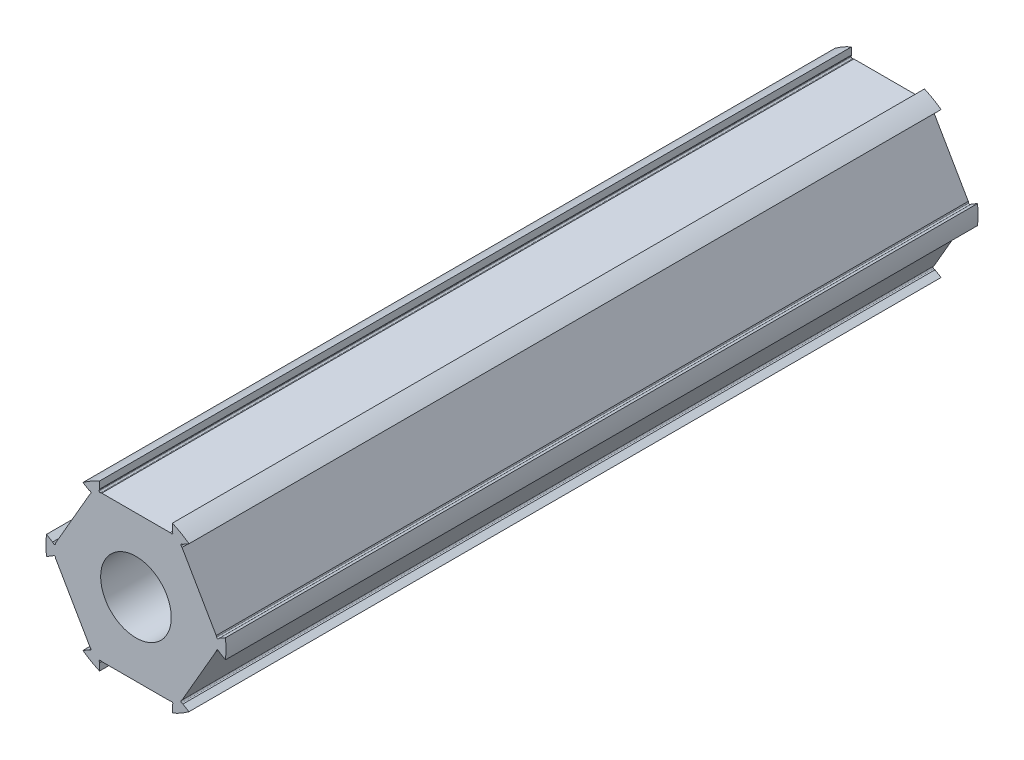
ISO-10303-21;
HEADER;
FILE_DESCRIPTION(('STEP AP214'),'2;1');
FILE_NAME('part.step','',(''),(''),'','','');
FILE_SCHEMA(('AUTOMOTIVE_DESIGN { 1 0 10303 214 1 1 1 1 }'));
ENDSEC;
DATA;
#1=APPLICATION_CONTEXT('core data for automotive mechanical design processes');
#2=APPLICATION_PROTOCOL_DEFINITION('international standard','automotive_design',2000,#1);
#3=PRODUCT_CONTEXT('',#1,'mechanical');
#4=PRODUCT('Part','Part','',(#3));
#5=PRODUCT_RELATED_PRODUCT_CATEGORY('part','',(#4));
#6=PRODUCT_DEFINITION_FORMATION('','',#4);
#7=PRODUCT_DEFINITION_CONTEXT('part definition',#1,'design');
#8=PRODUCT_DEFINITION('design','',#6,#7);
#9=PRODUCT_DEFINITION_SHAPE('','',#8);
#10=(LENGTH_UNIT() NAMED_UNIT(*) SI_UNIT(.MILLI.,.METRE.));
#11=(NAMED_UNIT(*) PLANE_ANGLE_UNIT() SI_UNIT($,.RADIAN.));
#12=(NAMED_UNIT(*) SI_UNIT($,.STERADIAN.) SOLID_ANGLE_UNIT());
#13=UNCERTAINTY_MEASURE_WITH_UNIT(LENGTH_MEASURE(1.E-05),#10,'distance_accuracy_value','');
#14=(GEOMETRIC_REPRESENTATION_CONTEXT(3) GLOBAL_UNCERTAINTY_ASSIGNED_CONTEXT((#13)) GLOBAL_UNIT_ASSIGNED_CONTEXT((#10,
#11,#12)) REPRESENTATION_CONTEXT('',''));
#15=CARTESIAN_POINT('',(0.,0.,0.));
#16=DIRECTION('',(0.,0.,1.));
#17=DIRECTION('',(1.,0.,0.));
#18=AXIS2_PLACEMENT_3D('',#15,#16,#17);
#19=CARTESIAN_POINT('',(0.,0.,0.));
#20=DIRECTION('',(0.,0.,1.));
#21=DIRECTION('',(1.,0.,0.));
#22=AXIS2_PLACEMENT_3D('',#19,#20,#21);
#23=CYLINDRICAL_SURFACE('',#22,7.9);
#24=CARTESIAN_POINT('',(0.,0.,66.));
#25=DIRECTION('',(0.,0.,1.));
#26=DIRECTION('',(1.,0.,0.));
#27=AXIS2_PLACEMENT_3D('',#24,#25,#26);
#28=CIRCLE('',#27,7.9);
#29=CARTESIAN_POINT('',(-4.65519783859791,6.38272144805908,66.));
#30=VERTEX_POINT('',#29);
#31=CARTESIAN_POINT('',(-3.2,7.22288031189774,66.));
#32=VERTEX_POINT('',#31);
#33=EDGE_CURVE('E428',#30,#32,#28,.F.);
#34=ORIENTED_EDGE('',*,*,#33,.T.);
#35=DIRECTION('',(0.,0.,1.));
#36=VECTOR('',#35,1.);
#37=CARTESIAN_POINT('',(-3.2,7.22288031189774,0.));
#38=LINE('',#37,#36);
#39=CARTESIAN_POINT('',(-3.2,7.22288031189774,0.));
#40=VERTEX_POINT('',#39);
#41=EDGE_CURVE('E410',#32,#40,#38,.F.);
#42=ORIENTED_EDGE('',*,*,#41,.T.);
#43=CARTESIAN_POINT('',(0.,0.,0.));
#44=DIRECTION('',(0.,0.,1.));
#45=DIRECTION('',(1.,0.,0.));
#46=AXIS2_PLACEMENT_3D('',#43,#44,#45);
#47=CIRCLE('',#46,7.9);
#48=CARTESIAN_POINT('',(-4.65519783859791,6.38272144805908,0.));
#49=VERTEX_POINT('',#48);
#50=EDGE_CURVE('E20',#40,#49,#47,.T.);
#51=ORIENTED_EDGE('',*,*,#50,.T.);
#52=DIRECTION('',(0.,0.,1.));
#53=VECTOR('',#52,1.);
#54=CARTESIAN_POINT('',(-4.65519783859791,6.38272144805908,0.));
#55=LINE('',#54,#53);
#56=EDGE_CURVE('E436',#30,#49,#55,.F.);
#57=ORIENTED_EDGE('',*,*,#56,.F.);
#58=EDGE_LOOP('',(#34,#42,#51,#57));
#59=FACE_BOUND('',#58,.T.);
#60=ADVANCED_FACE('F17',(#59),#23,.T.);
#61=CARTESIAN_POINT('',(0.,0.,0.));
#62=DIRECTION('',(0.,0.,1.));
#63=DIRECTION('',(1.,0.,0.));
#64=AXIS2_PLACEMENT_3D('',#61,#62,#63);
#65=CYLINDRICAL_SURFACE('',#64,7.9);
#66=CARTESIAN_POINT('',(0.,0.,66.));
#67=DIRECTION('',(0.,0.,1.));
#68=DIRECTION('',(1.,0.,0.));
#69=AXIS2_PLACEMENT_3D('',#66,#67,#68);
#70=CIRCLE('',#69,7.9);
#71=CARTESIAN_POINT('',(-7.85519783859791,-0.840158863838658,66.));
#72=VERTEX_POINT('',#71);
#73=CARTESIAN_POINT('',(-7.85519783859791,0.840158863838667,66.));
#74=VERTEX_POINT('',#73);
#75=EDGE_CURVE('E545',#72,#74,#70,.F.);
#76=ORIENTED_EDGE('',*,*,#75,.T.);
#77=DIRECTION('',(0.,0.,1.));
#78=VECTOR('',#77,1.);
#79=CARTESIAN_POINT('',(-7.85519783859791,0.840158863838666,0.));
#80=LINE('',#79,#78);
#81=CARTESIAN_POINT('',(-7.85519783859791,0.840158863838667,0.));
#82=VERTEX_POINT('',#81);
#83=EDGE_CURVE('E560',#74,#82,#80,.F.);
#84=ORIENTED_EDGE('',*,*,#83,.T.);
#85=CARTESIAN_POINT('',(0.,0.,0.));
#86=DIRECTION('',(0.,0.,1.));
#87=DIRECTION('',(1.,0.,0.));
#88=AXIS2_PLACEMENT_3D('',#85,#86,#87);
#89=CIRCLE('',#88,7.9);
#90=CARTESIAN_POINT('',(-7.85519783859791,-0.840158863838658,0.));
#91=VERTEX_POINT('',#90);
#92=EDGE_CURVE('E547',#82,#91,#89,.T.);
#93=ORIENTED_EDGE('',*,*,#92,.T.);
#94=DIRECTION('',(0.,0.,1.));
#95=VECTOR('',#94,1.);
#96=CARTESIAN_POINT('',(-7.85519783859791,-0.840158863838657,0.));
#97=LINE('',#96,#95);
#98=EDGE_CURVE('E558',#72,#91,#97,.F.);
#99=ORIENTED_EDGE('',*,*,#98,.F.);
#100=EDGE_LOOP('',(#76,#84,#93,#99));
#101=FACE_BOUND('',#100,.T.);
#102=ADVANCED_FACE('F557',(#101),#65,.T.);
#103=CARTESIAN_POINT('',(0.,0.,0.));
#104=DIRECTION('',(0.,0.,1.));
#105=DIRECTION('',(1.,0.,0.));
#106=AXIS2_PLACEMENT_3D('',#103,#104,#105);
#107=CYLINDRICAL_SURFACE('',#106,7.9);
#108=CARTESIAN_POINT('',(0.,0.,66.));
#109=DIRECTION('',(0.,0.,1.));
#110=DIRECTION('',(1.,0.,0.));
#111=AXIS2_PLACEMENT_3D('',#108,#109,#110);
#112=CIRCLE('',#111,7.9);
#113=CARTESIAN_POINT('',(-3.2,-7.22288031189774,66.));
#114=VERTEX_POINT('',#113);
#115=CARTESIAN_POINT('',(-4.65519783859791,-6.38272144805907,66.));
#116=VERTEX_POINT('',#115);
#117=EDGE_CURVE('E540',#114,#116,#112,.F.);
#118=ORIENTED_EDGE('',*,*,#117,.T.);
#119=DIRECTION('',(0.,0.,1.));
#120=VECTOR('',#119,1.);
#121=CARTESIAN_POINT('',(-4.65519783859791,-6.38272144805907,0.));
#122=LINE('',#121,#120);
#123=CARTESIAN_POINT('',(-4.65519783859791,-6.38272144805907,0.));
#124=VERTEX_POINT('',#123);
#125=EDGE_CURVE('E666',#116,#124,#122,.F.);
#126=ORIENTED_EDGE('',*,*,#125,.T.);
#127=CARTESIAN_POINT('',(0.,0.,0.));
#128=DIRECTION('',(0.,0.,1.));
#129=DIRECTION('',(1.,0.,0.));
#130=AXIS2_PLACEMENT_3D('',#127,#128,#129);
#131=CIRCLE('',#130,7.9);
#132=CARTESIAN_POINT('',(-3.2,-7.22288031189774,0.));
#133=VERTEX_POINT('',#132);
#134=EDGE_CURVE('E542',#124,#133,#131,.T.);
#135=ORIENTED_EDGE('',*,*,#134,.T.);
#136=DIRECTION('',(0.,0.,1.));
#137=VECTOR('',#136,1.);
#138=CARTESIAN_POINT('',(-3.2,-7.22288031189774,0.));
#139=LINE('',#138,#137);
#140=EDGE_CURVE('E660',#114,#133,#139,.F.);
#141=ORIENTED_EDGE('',*,*,#140,.F.);
#142=EDGE_LOOP('',(#118,#126,#135,#141));
#143=FACE_BOUND('',#142,.T.);
#144=ADVANCED_FACE('F1272',(#143),#107,.T.);
#145=CARTESIAN_POINT('',(0.,0.,0.));
#146=DIRECTION('',(0.,0.,1.));
#147=DIRECTION('',(1.,0.,0.));
#148=AXIS2_PLACEMENT_3D('',#145,#146,#147);
#149=CYLINDRICAL_SURFACE('',#148,7.9);
#150=CARTESIAN_POINT('',(0.,0.,66.));
#151=DIRECTION('',(0.,0.,1.));
#152=DIRECTION('',(1.,0.,0.));
#153=AXIS2_PLACEMENT_3D('',#150,#151,#152);
#154=CIRCLE('',#153,7.9);
#155=CARTESIAN_POINT('',(4.65519783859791,-6.38272144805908,66.));
#156=VERTEX_POINT('',#155);
#157=CARTESIAN_POINT('',(3.2,-7.22288031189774,66.));
#158=VERTEX_POINT('',#157);
#159=EDGE_CURVE('E536',#156,#158,#154,.F.);
#160=ORIENTED_EDGE('',*,*,#159,.T.);
#161=DIRECTION('',(0.,0.,1.));
#162=VECTOR('',#161,1.);
#163=CARTESIAN_POINT('',(3.2,-7.22288031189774,0.));
#164=LINE('',#163,#162);
#165=CARTESIAN_POINT('',(3.2,-7.22288031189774,0.));
#166=VERTEX_POINT('',#165);
#167=EDGE_CURVE('E655',#158,#166,#164,.F.);
#168=ORIENTED_EDGE('',*,*,#167,.T.);
#169=CARTESIAN_POINT('',(0.,0.,0.));
#170=DIRECTION('',(0.,0.,1.));
#171=DIRECTION('',(1.,0.,0.));
#172=AXIS2_PLACEMENT_3D('',#169,#170,#171);
#173=CIRCLE('',#172,7.9);
#174=CARTESIAN_POINT('',(4.65519783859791,-6.38272144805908,0.));
#175=VERTEX_POINT('',#174);
#176=EDGE_CURVE('E538',#166,#175,#173,.T.);
#177=ORIENTED_EDGE('',*,*,#176,.T.);
#178=DIRECTION('',(0.,0.,1.));
#179=VECTOR('',#178,1.);
#180=CARTESIAN_POINT('',(4.65519783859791,-6.38272144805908,0.));
#181=LINE('',#180,#179);
#182=EDGE_CURVE('E650',#156,#175,#181,.F.);
#183=ORIENTED_EDGE('',*,*,#182,.F.);
#184=EDGE_LOOP('',(#160,#168,#177,#183));
#185=FACE_BOUND('',#184,.T.);
#186=ADVANCED_FACE('F1234',(#185),#149,.T.);
#187=CARTESIAN_POINT('',(0.,0.,0.));
#188=DIRECTION('',(0.,0.,1.));
#189=DIRECTION('',(1.,0.,0.));
#190=AXIS2_PLACEMENT_3D('',#187,#188,#189);
#191=CYLINDRICAL_SURFACE('',#190,7.9);
#192=CARTESIAN_POINT('',(0.,0.,66.));
#193=DIRECTION('',(0.,0.,1.));
#194=DIRECTION('',(1.,0.,0.));
#195=AXIS2_PLACEMENT_3D('',#192,#193,#194);
#196=CIRCLE('',#195,7.9);
#197=CARTESIAN_POINT('',(7.85519783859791,0.840158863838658,66.));
#198=VERTEX_POINT('',#197);
#199=CARTESIAN_POINT('',(7.85519783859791,-0.840158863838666,66.));
#200=VERTEX_POINT('',#199);
#201=EDGE_CURVE('E532',#198,#200,#196,.F.);
#202=ORIENTED_EDGE('',*,*,#201,.T.);
#203=DIRECTION('',(0.,0.,1.));
#204=VECTOR('',#203,1.);
#205=CARTESIAN_POINT('',(7.85519783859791,-0.840158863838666,0.));
#206=LINE('',#205,#204);
#207=CARTESIAN_POINT('',(7.85519783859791,-0.840158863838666,0.));
#208=VERTEX_POINT('',#207);
#209=EDGE_CURVE('E645',#200,#208,#206,.F.);
#210=ORIENTED_EDGE('',*,*,#209,.T.);
#211=CARTESIAN_POINT('',(0.,0.,0.));
#212=DIRECTION('',(0.,0.,1.));
#213=DIRECTION('',(1.,0.,0.));
#214=AXIS2_PLACEMENT_3D('',#211,#212,#213);
#215=CIRCLE('',#214,7.9);
#216=CARTESIAN_POINT('',(7.85519783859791,0.840158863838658,0.));
#217=VERTEX_POINT('',#216);
#218=EDGE_CURVE('E534',#208,#217,#215,.T.);
#219=ORIENTED_EDGE('',*,*,#218,.T.);
#220=DIRECTION('',(0.,0.,1.));
#221=VECTOR('',#220,1.);
#222=CARTESIAN_POINT('',(7.85519783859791,0.840158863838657,0.));
#223=LINE('',#222,#221);
#224=EDGE_CURVE('E640',#198,#217,#223,.F.);
#225=ORIENTED_EDGE('',*,*,#224,.F.);
#226=EDGE_LOOP('',(#202,#210,#219,#225));
#227=FACE_BOUND('',#226,.T.);
#228=ADVANCED_FACE('F1190',(#227),#191,.T.);
#229=CARTESIAN_POINT('',(0.,0.,0.));
#230=DIRECTION('',(0.,0.,1.));
#231=DIRECTION('',(1.,0.,0.));
#232=AXIS2_PLACEMENT_3D('',#229,#230,#231);
#233=CYLINDRICAL_SURFACE('',#232,7.9);
#234=DIRECTION('',(0.,0.,1.));
#235=VECTOR('',#234,1.);
#236=CARTESIAN_POINT('',(3.2,7.22288031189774,0.));
#237=LINE('',#236,#235);
#238=CARTESIAN_POINT('',(3.2,7.22288031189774,66.));
#239=VERTEX_POINT('',#238);
#240=CARTESIAN_POINT('',(3.2,7.22288031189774,0.));
#241=VERTEX_POINT('',#240);
#242=EDGE_CURVE('E417',#239,#241,#237,.F.);
#243=ORIENTED_EDGE('',*,*,#242,.F.);
#244=CARTESIAN_POINT('',(0.,0.,66.));
#245=DIRECTION('',(0.,0.,1.));
#246=DIRECTION('',(1.,0.,0.));
#247=AXIS2_PLACEMENT_3D('',#244,#245,#246);
#248=CIRCLE('',#247,7.9);
#249=CARTESIAN_POINT('',(4.65519783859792,6.38272144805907,66.));
#250=VERTEX_POINT('',#249);
#251=EDGE_CURVE('E527',#239,#250,#248,.F.);
#252=ORIENTED_EDGE('',*,*,#251,.T.);
#253=DIRECTION('',(0.,0.,1.));
#254=VECTOR('',#253,1.);
#255=CARTESIAN_POINT('',(4.65519783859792,6.38272144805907,0.));
#256=LINE('',#255,#254);
#257=CARTESIAN_POINT('',(4.65519783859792,6.38272144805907,0.));
#258=VERTEX_POINT('',#257);
#259=EDGE_CURVE('E636',#250,#258,#256,.F.);
#260=ORIENTED_EDGE('',*,*,#259,.T.);
#261=CARTESIAN_POINT('',(0.,0.,0.));
#262=DIRECTION('',(0.,0.,1.));
#263=DIRECTION('',(1.,0.,0.));
#264=AXIS2_PLACEMENT_3D('',#261,#262,#263);
#265=CIRCLE('',#264,7.9);
#266=EDGE_CURVE('E530',#258,#241,#265,.T.);
#267=ORIENTED_EDGE('',*,*,#266,.T.);
#268=EDGE_LOOP('',(#243,#252,#260,#267));
#269=FACE_BOUND('',#268,.T.);
#270=ADVANCED_FACE('F1690',(#269),#233,.T.);
#271=CARTESIAN_POINT('',(3.2,7.9,0.));
#272=DIRECTION('',(-1.,0.,0.));
#273=DIRECTION('',(0.,-1.,0.));
#274=AXIS2_PLACEMENT_3D('',#271,#272,#273);
#275=PLANE('',#274);
#276=DIRECTION('',(0.,-1.,0.));
#277=VECTOR('',#276,1.);
#278=CARTESIAN_POINT('',(3.2,7.9,66.));
#279=LINE('',#278,#277);
#280=CARTESIAN_POINT('',(3.2,6.6,66.));
#281=VERTEX_POINT('',#280);
#282=EDGE_CURVE('E439',#281,#239,#279,.F.);
#283=ORIENTED_EDGE('',*,*,#282,.T.);
#284=ORIENTED_EDGE('',*,*,#242,.T.);
#285=DIRECTION('',(0.,-1.,0.));
#286=VECTOR('',#285,1.);
#287=CARTESIAN_POINT('',(3.2,7.9,0.));
#288=LINE('',#287,#286);
#289=CARTESIAN_POINT('',(3.2,6.6,0.));
#290=VERTEX_POINT('',#289);
#291=EDGE_CURVE('E529',#241,#290,#288,.T.);
#292=ORIENTED_EDGE('',*,*,#291,.T.);
#293=DIRECTION('',(0.,0.,1.));
#294=VECTOR('',#293,1.);
#295=CARTESIAN_POINT('',(3.2,6.6,0.));
#296=LINE('',#295,#294);
#297=EDGE_CURVE('E624',#281,#290,#296,.F.);
#298=ORIENTED_EDGE('',*,*,#297,.F.);
#299=EDGE_LOOP('',(#283,#284,#292,#298));
#300=FACE_BOUND('',#299,.T.);
#301=ADVANCED_FACE('F1683',(#300),#275,.T.);
#302=CARTESIAN_POINT('',(-3.2,7.9,0.));
#303=DIRECTION('',(-1.,0.,0.));
#304=DIRECTION('',(0.,-1.,0.));
#305=AXIS2_PLACEMENT_3D('',#302,#303,#304);
#306=PLANE('',#305);
#307=DIRECTION('',(0.,-1.,0.));
#308=VECTOR('',#307,1.);
#309=CARTESIAN_POINT('',(-3.2,7.9,66.));
#310=LINE('',#309,#308);
#311=CARTESIAN_POINT('',(-3.2,6.6,66.));
#312=VERTEX_POINT('',#311);
#313=EDGE_CURVE('E416',#312,#32,#310,.F.);
#314=ORIENTED_EDGE('',*,*,#313,.F.);
#315=DIRECTION('',(0.,0.,1.));
#316=VECTOR('',#315,1.);
#317=CARTESIAN_POINT('',(-3.2,6.6,0.));
#318=LINE('',#317,#316);
#319=CARTESIAN_POINT('',(-3.2,6.6,0.));
#320=VERTEX_POINT('',#319);
#321=EDGE_CURVE('E413',#312,#320,#318,.F.);
#322=ORIENTED_EDGE('',*,*,#321,.T.);
#323=DIRECTION('',(0.,-1.,0.));
#324=VECTOR('',#323,1.);
#325=CARTESIAN_POINT('',(-3.2,7.9,0.));
#326=LINE('',#325,#324);
#327=EDGE_CURVE('E406',#40,#320,#326,.T.);
#328=ORIENTED_EDGE('',*,*,#327,.F.);
#329=ORIENTED_EDGE('',*,*,#41,.F.);
#330=EDGE_LOOP('',(#314,#322,#328,#329));
#331=FACE_BOUND('',#330,.T.);
#332=ADVANCED_FACE('F408',(#331),#306,.F.);
#333=CARTESIAN_POINT('',(-5.24160068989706,6.72128129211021,0.));
#334=DIRECTION('',(-0.5,-0.866025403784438,0.));
#335=DIRECTION('',(0.866025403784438,-0.5,0.));
#336=AXIS2_PLACEMENT_3D('',#333,#334,#335);
#337=PLANE('',#336);
#338=DIRECTION('',(0.866025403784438,-0.5,0.));
#339=VECTOR('',#338,1.);
#340=CARTESIAN_POINT('',(-5.24160068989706,6.72128129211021,66.));
#341=LINE('',#340,#339);
#342=CARTESIAN_POINT('',(-4.11576766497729,6.07128129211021,66.));
#343=VERTEX_POINT('',#342);
#344=EDGE_CURVE('E431',#343,#30,#341,.F.);
#345=ORIENTED_EDGE('',*,*,#344,.T.);
#346=ORIENTED_EDGE('',*,*,#56,.T.);
#347=DIRECTION('',(0.866025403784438,-0.5,0.));
#348=VECTOR('',#347,1.);
#349=CARTESIAN_POINT('',(-5.24160068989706,6.72128129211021,0.));
#350=LINE('',#349,#348);
#351=CARTESIAN_POINT('',(-4.11576766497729,6.07128129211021,0.));
#352=VERTEX_POINT('',#351);
#353=EDGE_CURVE('E424',#49,#352,#350,.T.);
#354=ORIENTED_EDGE('',*,*,#353,.T.);
#355=DIRECTION('',(0.,0.,1.));
#356=VECTOR('',#355,1.);
#357=CARTESIAN_POINT('',(-4.11576766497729,6.07128129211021,0.));
#358=LINE('',#357,#356);
#359=EDGE_CURVE('E604',#343,#352,#358,.F.);
#360=ORIENTED_EDGE('',*,*,#359,.F.);
#361=EDGE_LOOP('',(#345,#346,#354,#360));
#362=FACE_BOUND('',#361,.T.);
#363=ADVANCED_FACE('F1668',(#362),#337,.T.);
#364=CARTESIAN_POINT('',(-8.44160068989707,1.1787187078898,0.));
#365=DIRECTION('',(-0.5,-0.866025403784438,0.));
#366=DIRECTION('',(0.866025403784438,-0.5,0.));
#367=AXIS2_PLACEMENT_3D('',#364,#365,#366);
#368=PLANE('',#367);
#369=DIRECTION('',(0.866025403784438,-0.5,0.));
#370=VECTOR('',#369,1.);
#371=CARTESIAN_POINT('',(-8.44160068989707,1.1787187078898,66.));
#372=LINE('',#371,#370);
#373=CARTESIAN_POINT('',(-7.3157676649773,0.528718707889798,66.));
#374=VERTEX_POINT('',#373);
#375=EDGE_CURVE('E579',#374,#74,#372,.F.);
#376=ORIENTED_EDGE('',*,*,#375,.F.);
#377=DIRECTION('',(0.,0.,1.));
#378=VECTOR('',#377,1.);
#379=CARTESIAN_POINT('',(-7.3157676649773,0.528718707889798,0.));
#380=LINE('',#379,#378);
#381=CARTESIAN_POINT('',(-7.3157676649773,0.528718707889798,0.));
#382=VERTEX_POINT('',#381);
#383=EDGE_CURVE('E588',#374,#382,#380,.F.);
#384=ORIENTED_EDGE('',*,*,#383,.T.);
#385=DIRECTION('',(0.866025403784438,-0.5,0.));
#386=VECTOR('',#385,1.);
#387=CARTESIAN_POINT('',(-8.44160068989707,1.1787187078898,0.));
#388=LINE('',#387,#386);
#389=EDGE_CURVE('E598',#82,#382,#388,.T.);
#390=ORIENTED_EDGE('',*,*,#389,.F.);
#391=ORIENTED_EDGE('',*,*,#83,.F.);
#392=EDGE_LOOP('',(#376,#384,#390,#391));
#393=FACE_BOUND('',#392,.T.);
#394=ADVANCED_FACE('F1661',(#393),#368,.F.);
#395=CARTESIAN_POINT('',(-8.44160068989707,-1.17871870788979,0.));
#396=DIRECTION('',(0.5,-0.866025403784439,0.));
#397=DIRECTION('',(0.866025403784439,0.5,0.));
#398=AXIS2_PLACEMENT_3D('',#395,#396,#397);
#399=PLANE('',#398);
#400=DIRECTION('',(0.866025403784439,0.5,0.));
#401=VECTOR('',#400,1.);
#402=CARTESIAN_POINT('',(-8.44160068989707,-1.17871870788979,66.));
#403=LINE('',#402,#401);
#404=CARTESIAN_POINT('',(-7.3157676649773,-0.528718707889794,66.));
#405=VERTEX_POINT('',#404);
#406=EDGE_CURVE('E568',#405,#72,#403,.F.);
#407=ORIENTED_EDGE('',*,*,#406,.T.);
#408=ORIENTED_EDGE('',*,*,#98,.T.);
#409=DIRECTION('',(0.866025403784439,0.5,0.));
#410=VECTOR('',#409,1.);
#411=CARTESIAN_POINT('',(-8.44160068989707,-1.17871870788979,0.));
#412=LINE('',#411,#410);
#413=CARTESIAN_POINT('',(-7.3157676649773,-0.528718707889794,0.));
#414=VERTEX_POINT('',#413);
#415=EDGE_CURVE('E565',#91,#414,#412,.T.);
#416=ORIENTED_EDGE('',*,*,#415,.T.);
#417=DIRECTION('',(0.,0.,1.));
#418=VECTOR('',#417,1.);
#419=CARTESIAN_POINT('',(-7.3157676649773,-0.528718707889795,0.));
#420=LINE('',#419,#418);
#421=EDGE_CURVE('E689',#405,#414,#420,.F.);
#422=ORIENTED_EDGE('',*,*,#421,.F.);
#423=EDGE_LOOP('',(#407,#408,#416,#422));
#424=FACE_BOUND('',#423,.T.);
#425=ADVANCED_FACE('F563',(#424),#399,.T.);
#426=CARTESIAN_POINT('',(-5.24160068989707,-6.7212812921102,0.));
#427=DIRECTION('',(0.5,-0.866025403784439,0.));
#428=DIRECTION('',(0.866025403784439,0.5,0.));
#429=AXIS2_PLACEMENT_3D('',#426,#427,#428);
#430=PLANE('',#429);
#431=DIRECTION('',(0.866025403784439,0.5,0.));
#432=VECTOR('',#431,1.);
#433=CARTESIAN_POINT('',(-5.24160068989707,-6.7212812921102,66.));
#434=LINE('',#433,#432);
#435=CARTESIAN_POINT('',(-4.1157676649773,-6.0712812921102,66.));
#436=VERTEX_POINT('',#435);
#437=EDGE_CURVE('E670',#436,#116,#434,.F.);
#438=ORIENTED_EDGE('',*,*,#437,.F.);
#439=DIRECTION('',(0.,0.,1.));
#440=VECTOR('',#439,1.);
#441=CARTESIAN_POINT('',(-4.1157676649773,-6.0712812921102,0.));
#442=LINE('',#441,#440);
#443=CARTESIAN_POINT('',(-4.1157676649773,-6.0712812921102,0.));
#444=VERTEX_POINT('',#443);
#445=EDGE_CURVE('E695',#436,#444,#442,.F.);
#446=ORIENTED_EDGE('',*,*,#445,.T.);
#447=DIRECTION('',(0.866025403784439,0.5,0.));
#448=VECTOR('',#447,1.);
#449=CARTESIAN_POINT('',(-5.24160068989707,-6.7212812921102,0.));
#450=LINE('',#449,#448);
#451=EDGE_CURVE('E571',#124,#444,#450,.T.);
#452=ORIENTED_EDGE('',*,*,#451,.F.);
#453=ORIENTED_EDGE('',*,*,#125,.F.);
#454=EDGE_LOOP('',(#438,#446,#452,#453));
#455=FACE_BOUND('',#454,.T.);
#456=ADVANCED_FACE('F1273',(#455),#430,.F.);
#457=CARTESIAN_POINT('',(-3.2,-7.9,0.));
#458=DIRECTION('',(1.,0.,0.));
#459=DIRECTION('',(0.,1.,0.));
#460=AXIS2_PLACEMENT_3D('',#457,#458,#459);
#461=PLANE('',#460);
#462=DIRECTION('',(0.,1.,0.));
#463=VECTOR('',#462,1.);
#464=CARTESIAN_POINT('',(-3.2,-7.9,66.));
#465=LINE('',#464,#463);
#466=CARTESIAN_POINT('',(-3.2,-6.6,66.));
#467=VERTEX_POINT('',#466);
#468=EDGE_CURVE('E665',#467,#114,#465,.F.);
#469=ORIENTED_EDGE('',*,*,#468,.T.);
#470=ORIENTED_EDGE('',*,*,#140,.T.);
#471=DIRECTION('',(0.,1.,0.));
#472=VECTOR('',#471,1.);
#473=CARTESIAN_POINT('',(-3.2,-7.9,0.));
#474=LINE('',#473,#472);
#475=CARTESIAN_POINT('',(-3.2,-6.6,0.));
#476=VERTEX_POINT('',#475);
#477=EDGE_CURVE('E669',#133,#476,#474,.T.);
#478=ORIENTED_EDGE('',*,*,#477,.T.);
#479=DIRECTION('',(0.,0.,1.));
#480=VECTOR('',#479,1.);
#481=CARTESIAN_POINT('',(-3.2,-6.6,0.));
#482=LINE('',#481,#480);
#483=EDGE_CURVE('E809',#467,#476,#482,.F.);
#484=ORIENTED_EDGE('',*,*,#483,.F.);
#485=EDGE_LOOP('',(#469,#470,#478,#484));
#486=FACE_BOUND('',#485,.T.);
#487=ADVANCED_FACE('F1269',(#486),#461,.T.);
#488=CARTESIAN_POINT('',(3.2,-7.9,0.));
#489=DIRECTION('',(1.,0.,0.));
#490=DIRECTION('',(0.,1.,0.));
#491=AXIS2_PLACEMENT_3D('',#488,#489,#490);
#492=PLANE('',#491);
#493=DIRECTION('',(0.,1.,0.));
#494=VECTOR('',#493,1.);
#495=CARTESIAN_POINT('',(3.2,-7.9,66.));
#496=LINE('',#495,#494);
#497=CARTESIAN_POINT('',(3.2,-6.6,66.));
#498=VERTEX_POINT('',#497);
#499=EDGE_CURVE('E659',#498,#158,#496,.F.);
#500=ORIENTED_EDGE('',*,*,#499,.F.);
#501=DIRECTION('',(0.,0.,1.));
#502=VECTOR('',#501,1.);
#503=CARTESIAN_POINT('',(3.2,-6.6,0.));
#504=LINE('',#503,#502);
#505=CARTESIAN_POINT('',(3.2,-6.6,0.));
#506=VERTEX_POINT('',#505);
#507=EDGE_CURVE('E795',#498,#506,#504,.F.);
#508=ORIENTED_EDGE('',*,*,#507,.T.);
#509=DIRECTION('',(0.,1.,0.));
#510=VECTOR('',#509,1.);
#511=CARTESIAN_POINT('',(3.2,-7.9,0.));
#512=LINE('',#511,#510);
#513=EDGE_CURVE('E664',#166,#506,#512,.T.);
#514=ORIENTED_EDGE('',*,*,#513,.F.);
#515=ORIENTED_EDGE('',*,*,#167,.F.);
#516=EDGE_LOOP('',(#500,#508,#514,#515));
#517=FACE_BOUND('',#516,.T.);
#518=ADVANCED_FACE('F1236',(#517),#492,.F.);
#519=CARTESIAN_POINT('',(5.24160068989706,-6.72128129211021,0.));
#520=DIRECTION('',(0.500000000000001,0.866025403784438,0.));
#521=DIRECTION('',(-0.866025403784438,0.500000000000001,0.));
#522=AXIS2_PLACEMENT_3D('',#519,#520,#521);
#523=PLANE('',#522);
#524=DIRECTION('',(-0.866025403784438,0.500000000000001,0.));
#525=VECTOR('',#524,1.);
#526=CARTESIAN_POINT('',(5.24160068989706,-6.72128129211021,66.));
#527=LINE('',#526,#525);
#528=CARTESIAN_POINT('',(4.11576766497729,-6.07128129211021,66.));
#529=VERTEX_POINT('',#528);
#530=EDGE_CURVE('E654',#529,#156,#527,.F.);
#531=ORIENTED_EDGE('',*,*,#530,.T.);
#532=ORIENTED_EDGE('',*,*,#182,.T.);
#533=DIRECTION('',(-0.866025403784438,0.500000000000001,0.));
#534=VECTOR('',#533,1.);
#535=CARTESIAN_POINT('',(5.24160068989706,-6.72128129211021,0.));
#536=LINE('',#535,#534);
#537=CARTESIAN_POINT('',(4.11576766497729,-6.07128129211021,0.));
#538=VERTEX_POINT('',#537);
#539=EDGE_CURVE('E658',#175,#538,#536,.T.);
#540=ORIENTED_EDGE('',*,*,#539,.T.);
#541=DIRECTION('',(0.,0.,1.));
#542=VECTOR('',#541,1.);
#543=CARTESIAN_POINT('',(4.11576766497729,-6.07128129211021,0.));
#544=LINE('',#543,#542);
#545=EDGE_CURVE('E783',#529,#538,#544,.F.);
#546=ORIENTED_EDGE('',*,*,#545,.F.);
#547=EDGE_LOOP('',(#531,#532,#540,#546));
#548=FACE_BOUND('',#547,.T.);
#549=ADVANCED_FACE('F1227',(#548),#523,.T.);
#550=CARTESIAN_POINT('',(8.44160068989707,-1.1787187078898,0.));
#551=DIRECTION('',(0.500000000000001,0.866025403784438,0.));
#552=DIRECTION('',(-0.866025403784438,0.500000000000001,0.));
#553=AXIS2_PLACEMENT_3D('',#550,#551,#552);
#554=PLANE('',#553);
#555=DIRECTION('',(-0.866025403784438,0.500000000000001,0.));
#556=VECTOR('',#555,1.);
#557=CARTESIAN_POINT('',(8.44160068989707,-1.1787187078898,66.));
#558=LINE('',#557,#556);
#559=CARTESIAN_POINT('',(7.3157676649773,-0.528718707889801,66.));
#560=VERTEX_POINT('',#559);
#561=EDGE_CURVE('E649',#560,#200,#558,.F.);
#562=ORIENTED_EDGE('',*,*,#561,.F.);
#563=DIRECTION('',(0.,0.,1.));
#564=VECTOR('',#563,1.);
#565=CARTESIAN_POINT('',(7.3157676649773,-0.528718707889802,0.));
#566=LINE('',#565,#564);
#567=CARTESIAN_POINT('',(7.3157676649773,-0.528718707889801,0.));
#568=VERTEX_POINT('',#567);
#569=EDGE_CURVE('E769',#560,#568,#566,.F.);
#570=ORIENTED_EDGE('',*,*,#569,.T.);
#571=DIRECTION('',(-0.866025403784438,0.500000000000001,0.));
#572=VECTOR('',#571,1.);
#573=CARTESIAN_POINT('',(8.44160068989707,-1.1787187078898,0.));
#574=LINE('',#573,#572);
#575=EDGE_CURVE('E653',#208,#568,#574,.T.);
#576=ORIENTED_EDGE('',*,*,#575,.F.);
#577=ORIENTED_EDGE('',*,*,#209,.F.);
#578=EDGE_LOOP('',(#562,#570,#576,#577));
#579=FACE_BOUND('',#578,.T.);
#580=ADVANCED_FACE('F1193',(#579),#554,.F.);
#581=CARTESIAN_POINT('',(8.44160068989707,1.17871870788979,0.));
#582=DIRECTION('',(-0.499999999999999,0.866025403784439,0.));
#583=DIRECTION('',(-0.866025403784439,-0.499999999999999,0.));
#584=AXIS2_PLACEMENT_3D('',#581,#582,#583);
#585=PLANE('',#584);
#586=DIRECTION('',(-0.866025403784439,-0.499999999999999,0.));
#587=VECTOR('',#586,1.);
#588=CARTESIAN_POINT('',(8.44160068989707,1.17871870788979,66.));
#589=LINE('',#588,#587);
#590=CARTESIAN_POINT('',(7.3157676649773,0.528718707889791,66.));
#591=VERTEX_POINT('',#590);
#592=EDGE_CURVE('E644',#591,#198,#589,.F.);
#593=ORIENTED_EDGE('',*,*,#592,.T.);
#594=ORIENTED_EDGE('',*,*,#224,.T.);
#595=DIRECTION('',(-0.866025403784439,-0.499999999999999,0.));
#596=VECTOR('',#595,1.);
#597=CARTESIAN_POINT('',(8.44160068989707,1.17871870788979,0.));
#598=LINE('',#597,#596);
#599=CARTESIAN_POINT('',(7.3157676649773,0.528718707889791,0.));
#600=VERTEX_POINT('',#599);
#601=EDGE_CURVE('E648',#217,#600,#598,.T.);
#602=ORIENTED_EDGE('',*,*,#601,.T.);
#603=DIRECTION('',(0.,0.,1.));
#604=VECTOR('',#603,1.);
#605=CARTESIAN_POINT('',(7.3157676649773,0.528718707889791,0.));
#606=LINE('',#605,#604);
#607=EDGE_CURVE('E757',#591,#600,#606,.F.);
#608=ORIENTED_EDGE('',*,*,#607,.F.);
#609=EDGE_LOOP('',(#593,#594,#602,#608));
#610=FACE_BOUND('',#609,.T.);
#611=ADVANCED_FACE('F1186',(#610),#585,.T.);
#612=CARTESIAN_POINT('',(5.24160068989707,6.7212812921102,0.));
#613=DIRECTION('',(-0.499999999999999,0.866025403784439,0.));
#614=DIRECTION('',(-0.866025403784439,-0.499999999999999,0.));
#615=AXIS2_PLACEMENT_3D('',#612,#613,#614);
#616=PLANE('',#615);
#617=DIRECTION('',(-0.866025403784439,-0.499999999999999,0.));
#618=VECTOR('',#617,1.);
#619=CARTESIAN_POINT('',(5.24160068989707,6.7212812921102,66.));
#620=LINE('',#619,#618);
#621=CARTESIAN_POINT('',(4.1157676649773,6.0712812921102,66.));
#622=VERTEX_POINT('',#621);
#623=EDGE_CURVE('E639',#622,#250,#620,.F.);
#624=ORIENTED_EDGE('',*,*,#623,.F.);
#625=DIRECTION('',(0.,0.,1.));
#626=VECTOR('',#625,1.);
#627=CARTESIAN_POINT('',(4.1157676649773,6.0712812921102,0.));
#628=LINE('',#627,#626);
#629=CARTESIAN_POINT('',(4.1157676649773,6.0712812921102,0.));
#630=VERTEX_POINT('',#629);
#631=EDGE_CURVE('E743',#622,#630,#628,.F.);
#632=ORIENTED_EDGE('',*,*,#631,.T.);
#633=DIRECTION('',(-0.866025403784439,-0.499999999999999,0.));
#634=VECTOR('',#633,1.);
#635=CARTESIAN_POINT('',(5.24160068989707,6.7212812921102,0.));
#636=LINE('',#635,#634);
#637=EDGE_CURVE('E643',#258,#630,#636,.T.);
#638=ORIENTED_EDGE('',*,*,#637,.F.);
#639=ORIENTED_EDGE('',*,*,#259,.F.);
#640=EDGE_LOOP('',(#624,#632,#638,#639));
#641=FACE_BOUND('',#640,.T.);
#642=ADVANCED_FACE('F1610',(#641),#616,.F.);
#643=CARTESIAN_POINT('',(3.2,6.6,0.));
#644=DIRECTION('',(-0.965925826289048,-0.258819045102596,0.));
#645=DIRECTION('',(0.258819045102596,-0.965925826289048,0.));
#646=AXIS2_PLACEMENT_3D('',#643,#644,#645);
#647=PLANE('',#646);
#648=DIRECTION('',(0.258819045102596,-0.965925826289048,0.));
#649=VECTOR('',#648,1.);
#650=CARTESIAN_POINT('',(3.2,6.6,0.));
#651=LINE('',#650,#649);
#652=CARTESIAN_POINT('',(3.22837630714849,6.49409817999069,0.));
#653=VERTEX_POINT('',#652);
#654=EDGE_CURVE('E617',#290,#653,#651,.T.);
#655=ORIENTED_EDGE('',*,*,#654,.T.);
#656=DIRECTION('',(0.,0.,1.));
#657=VECTOR('',#656,1.);
#658=CARTESIAN_POINT('',(3.22837630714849,6.49409817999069,0.));
#659=LINE('',#658,#657);
#660=CARTESIAN_POINT('',(3.22837630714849,6.49409817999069,66.));
#661=VERTEX_POINT('',#660);
#662=EDGE_CURVE('E522',#653,#661,#659,.T.);
#663=ORIENTED_EDGE('',*,*,#662,.T.);
#664=DIRECTION('',(0.258819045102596,-0.965925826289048,0.));
#665=VECTOR('',#664,1.);
#666=CARTESIAN_POINT('',(3.2,6.6,66.));
#667=LINE('',#666,#665);
#668=EDGE_CURVE('E627',#661,#281,#667,.F.);
#669=ORIENTED_EDGE('',*,*,#668,.T.);
#670=ORIENTED_EDGE('',*,*,#297,.T.);
#671=EDGE_LOOP('',(#655,#663,#669,#670));
#672=FACE_BOUND('',#671,.T.);
#673=ADVANCED_FACE('F1602',(#672),#647,.T.);
#674=CARTESIAN_POINT('',(-3.2,6.6,0.));
#675=DIRECTION('',(-0.965925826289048,0.258819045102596,0.));
#676=DIRECTION('',(-0.258819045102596,-0.965925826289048,0.));
#677=AXIS2_PLACEMENT_3D('',#674,#675,#676);
#678=PLANE('',#677);
#679=DIRECTION('',(0.,0.,1.));
#680=VECTOR('',#679,1.);
#681=CARTESIAN_POINT('',(-3.22837630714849,6.49409817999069,0.));
#682=LINE('',#681,#680);
#683=CARTESIAN_POINT('',(-3.22837630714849,6.49409817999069,66.));
#684=VERTEX_POINT('',#683);
#685=CARTESIAN_POINT('',(-3.22837630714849,6.49409817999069,0.));
#686=VERTEX_POINT('',#685);
#687=EDGE_CURVE('E519',#684,#686,#682,.F.);
#688=ORIENTED_EDGE('',*,*,#687,.T.);
#689=DIRECTION('',(-0.258819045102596,-0.965925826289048,0.));
#690=VECTOR('',#689,1.);
#691=CARTESIAN_POINT('',(-3.2,6.6,0.));
#692=LINE('',#691,#690);
#693=EDGE_CURVE('E616',#320,#686,#692,.T.);
#694=ORIENTED_EDGE('',*,*,#693,.F.);
#695=ORIENTED_EDGE('',*,*,#321,.F.);
#696=DIRECTION('',(-0.258819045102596,-0.965925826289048,0.));
#697=VECTOR('',#696,1.);
#698=CARTESIAN_POINT('',(-3.2,6.6,66.));
#699=LINE('',#698,#697);
#700=EDGE_CURVE('E720',#684,#312,#699,.F.);
#701=ORIENTED_EDGE('',*,*,#700,.F.);
#702=EDGE_LOOP('',(#688,#694,#695,#701));
#703=FACE_BOUND('',#702,.T.);
#704=ADVANCED_FACE('F1594',(#703),#678,.F.);
#705=CARTESIAN_POINT('',(-4.11576766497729,6.07128129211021,0.));
#706=DIRECTION('',(-0.258819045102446,-0.965925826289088,0.));
#707=DIRECTION('',(0.965925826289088,-0.258819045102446,0.));
#708=AXIS2_PLACEMENT_3D('',#705,#706,#707);
#709=PLANE('',#708);
#710=DIRECTION('',(0.965925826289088,-0.258819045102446,0.));
#711=VECTOR('',#710,1.);
#712=CARTESIAN_POINT('',(-4.11576766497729,6.07128129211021,0.));
#713=LINE('',#712,#711);
#714=CARTESIAN_POINT('',(-4.00986584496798,6.04290498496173,0.));
#715=VERTEX_POINT('',#714);
#716=EDGE_CURVE('E593',#352,#715,#713,.T.);
#717=ORIENTED_EDGE('',*,*,#716,.T.);
#718=DIRECTION('',(0.,0.,1.));
#719=VECTOR('',#718,1.);
#720=CARTESIAN_POINT('',(-4.00986584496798,6.04290498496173,0.));
#721=LINE('',#720,#719);
#722=CARTESIAN_POINT('',(-4.00986584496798,6.04290498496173,66.));
#723=VERTEX_POINT('',#722);
#724=EDGE_CURVE('E509',#715,#723,#721,.T.);
#725=ORIENTED_EDGE('',*,*,#724,.T.);
#726=DIRECTION('',(0.965925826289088,-0.258819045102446,0.));
#727=VECTOR('',#726,1.);
#728=CARTESIAN_POINT('',(-4.11576766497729,6.07128129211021,66.));
#729=LINE('',#728,#727);
#730=EDGE_CURVE('E607',#723,#343,#729,.F.);
#731=ORIENTED_EDGE('',*,*,#730,.T.);
#732=ORIENTED_EDGE('',*,*,#359,.T.);
#733=EDGE_LOOP('',(#717,#725,#731,#732));
#734=FACE_BOUND('',#733,.T.);
#735=ADVANCED_FACE('F1309',(#734),#709,.T.);
#736=CARTESIAN_POINT('',(-7.3157676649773,0.528718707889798,0.));
#737=DIRECTION('',(-0.707106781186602,-0.707106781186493,0.));
#738=DIRECTION('',(0.707106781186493,-0.707106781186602,0.));
#739=AXIS2_PLACEMENT_3D('',#736,#737,#738);
#740=PLANE('',#739);
#741=DIRECTION('',(0.,0.,1.));
#742=VECTOR('',#741,1.);
#743=CARTESIAN_POINT('',(-7.23824215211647,0.451193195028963,0.));
#744=LINE('',#743,#742);
#745=CARTESIAN_POINT('',(-7.23824215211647,0.451193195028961,66.));
#746=VERTEX_POINT('',#745);
#747=CARTESIAN_POINT('',(-7.23824215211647,0.451193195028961,0.));
#748=VERTEX_POINT('',#747);
#749=EDGE_CURVE('E506',#746,#748,#744,.F.);
#750=ORIENTED_EDGE('',*,*,#749,.T.);
#751=DIRECTION('',(0.707106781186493,-0.707106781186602,0.));
#752=VECTOR('',#751,1.);
#753=CARTESIAN_POINT('',(-7.3157676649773,0.528718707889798,0.));
#754=LINE('',#753,#752);
#755=EDGE_CURVE('E592',#382,#748,#754,.T.);
#756=ORIENTED_EDGE('',*,*,#755,.F.);
#757=ORIENTED_EDGE('',*,*,#383,.F.);
#758=DIRECTION('',(0.707106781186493,-0.707106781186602,0.));
#759=VECTOR('',#758,1.);
#760=CARTESIAN_POINT('',(-7.3157676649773,0.528718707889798,66.));
#761=LINE('',#760,#759);
#762=EDGE_CURVE('E697',#746,#374,#761,.F.);
#763=ORIENTED_EDGE('',*,*,#762,.F.);
#764=EDGE_LOOP('',(#750,#756,#757,#763));
#765=FACE_BOUND('',#764,.T.);
#766=ADVANCED_FACE('F1301',(#765),#740,.F.);
#767=CARTESIAN_POINT('',(-7.3157676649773,-0.528718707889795,0.));
#768=DIRECTION('',(0.707106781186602,-0.707106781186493,0.));
#769=DIRECTION('',(0.707106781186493,0.707106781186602,0.));
#770=AXIS2_PLACEMENT_3D('',#767,#768,#769);
#771=PLANE('',#770);
#772=DIRECTION('',(0.707106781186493,0.707106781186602,0.));
#773=VECTOR('',#772,1.);
#774=CARTESIAN_POINT('',(-7.3157676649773,-0.528718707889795,0.));
#775=LINE('',#774,#773);
#776=CARTESIAN_POINT('',(-7.23824215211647,-0.451193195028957,0.));
#777=VERTEX_POINT('',#776);
#778=EDGE_CURVE('E574',#414,#777,#775,.T.);
#779=ORIENTED_EDGE('',*,*,#778,.T.);
#780=DIRECTION('',(0.,0.,1.));
#781=VECTOR('',#780,1.);
#782=CARTESIAN_POINT('',(-7.23824215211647,-0.451193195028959,0.));
#783=LINE('',#782,#781);
#784=CARTESIAN_POINT('',(-7.23824215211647,-0.451193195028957,66.));
#785=VERTEX_POINT('',#784);
#786=EDGE_CURVE('E495',#777,#785,#783,.T.);
#787=ORIENTED_EDGE('',*,*,#786,.T.);
#788=DIRECTION('',(0.707106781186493,0.707106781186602,0.));
#789=VECTOR('',#788,1.);
#790=CARTESIAN_POINT('',(-7.3157676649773,-0.528718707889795,66.));
#791=LINE('',#790,#789);
#792=EDGE_CURVE('E691',#785,#405,#791,.F.);
#793=ORIENTED_EDGE('',*,*,#792,.T.);
#794=ORIENTED_EDGE('',*,*,#421,.T.);
#795=EDGE_LOOP('',(#779,#787,#793,#794));
#796=FACE_BOUND('',#795,.T.);
#797=ADVANCED_FACE('F1299',(#796),#771,.T.);
#798=CARTESIAN_POINT('',(-4.1157676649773,-6.0712812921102,0.));
#799=DIRECTION('',(0.258819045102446,-0.965925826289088,0.));
#800=DIRECTION('',(0.965925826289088,0.258819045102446,0.));
#801=AXIS2_PLACEMENT_3D('',#798,#799,#800);
#802=PLANE('',#801);
#803=DIRECTION('',(0.,0.,1.));
#804=VECTOR('',#803,1.);
#805=CARTESIAN_POINT('',(-4.00986584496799,-6.04290498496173,0.));
#806=LINE('',#805,#804);
#807=CARTESIAN_POINT('',(-4.00986584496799,-6.04290498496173,66.));
#808=VERTEX_POINT('',#807);
#809=CARTESIAN_POINT('',(-4.00986584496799,-6.04290498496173,0.));
#810=VERTEX_POINT('',#809);
#811=EDGE_CURVE('E492',#808,#810,#806,.F.);
#812=ORIENTED_EDGE('',*,*,#811,.T.);
#813=DIRECTION('',(0.965925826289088,0.258819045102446,0.));
#814=VECTOR('',#813,1.);
#815=CARTESIAN_POINT('',(-4.1157676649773,-6.0712812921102,0.));
#816=LINE('',#815,#814);
#817=EDGE_CURVE('E822',#444,#810,#816,.T.);
#818=ORIENTED_EDGE('',*,*,#817,.F.);
#819=ORIENTED_EDGE('',*,*,#445,.F.);
#820=DIRECTION('',(0.965925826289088,0.258819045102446,0.));
#821=VECTOR('',#820,1.);
#822=CARTESIAN_POINT('',(-4.1157676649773,-6.0712812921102,66.));
#823=LINE('',#822,#821);
#824=EDGE_CURVE('E828',#808,#436,#823,.F.);
#825=ORIENTED_EDGE('',*,*,#824,.F.);
#826=EDGE_LOOP('',(#812,#818,#819,#825));
#827=FACE_BOUND('',#826,.T.);
#828=ADVANCED_FACE('F1275',(#827),#802,.F.);
#829=CARTESIAN_POINT('',(-3.2,-6.6,0.));
#830=DIRECTION('',(0.965925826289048,0.258819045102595,0.));
#831=DIRECTION('',(-0.258819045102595,0.965925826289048,0.));
#832=AXIS2_PLACEMENT_3D('',#829,#830,#831);
#833=PLANE('',#832);
#834=DIRECTION('',(-0.258819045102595,0.965925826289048,0.));
#835=VECTOR('',#834,1.);
#836=CARTESIAN_POINT('',(-3.2,-6.6,0.));
#837=LINE('',#836,#835);
#838=CARTESIAN_POINT('',(-3.22837630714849,-6.49409817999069,0.));
#839=VERTEX_POINT('',#838);
#840=EDGE_CURVE('E799',#476,#839,#837,.T.);
#841=ORIENTED_EDGE('',*,*,#840,.T.);
#842=DIRECTION('',(0.,0.,1.));
#843=VECTOR('',#842,1.);
#844=CARTESIAN_POINT('',(-3.22837630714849,-6.49409817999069,0.));
#845=LINE('',#844,#843);
#846=CARTESIAN_POINT('',(-3.22837630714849,-6.49409817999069,66.));
#847=VERTEX_POINT('',#846);
#848=EDGE_CURVE('E480',#839,#847,#845,.T.);
#849=ORIENTED_EDGE('',*,*,#848,.T.);
#850=DIRECTION('',(-0.258819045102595,0.965925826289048,0.));
#851=VECTOR('',#850,1.);
#852=CARTESIAN_POINT('',(-3.2,-6.6,66.));
#853=LINE('',#852,#851);
#854=EDGE_CURVE('E813',#847,#467,#853,.F.);
#855=ORIENTED_EDGE('',*,*,#854,.T.);
#856=ORIENTED_EDGE('',*,*,#483,.T.);
#857=EDGE_LOOP('',(#841,#849,#855,#856));
#858=FACE_BOUND('',#857,.T.);
#859=ADVANCED_FACE('F1265',(#858),#833,.T.);
#860=CARTESIAN_POINT('',(3.2,-6.6,0.));
#861=DIRECTION('',(0.965925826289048,-0.258819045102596,0.));
#862=DIRECTION('',(0.258819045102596,0.965925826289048,0.));
#863=AXIS2_PLACEMENT_3D('',#860,#861,#862);
#864=PLANE('',#863);
#865=DIRECTION('',(0.,0.,1.));
#866=VECTOR('',#865,1.);
#867=CARTESIAN_POINT('',(3.22837630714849,-6.49409817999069,0.));
#868=LINE('',#867,#866);
#869=CARTESIAN_POINT('',(3.22837630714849,-6.49409817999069,66.));
#870=VERTEX_POINT('',#869);
#871=CARTESIAN_POINT('',(3.22837630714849,-6.49409817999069,0.));
#872=VERTEX_POINT('',#871);
#873=EDGE_CURVE('E477',#870,#872,#868,.F.);
#874=ORIENTED_EDGE('',*,*,#873,.T.);
#875=DIRECTION('',(0.258819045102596,0.965925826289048,0.));
#876=VECTOR('',#875,1.);
#877=CARTESIAN_POINT('',(3.2,-6.6,0.));
#878=LINE('',#877,#876);
#879=EDGE_CURVE('E798',#506,#872,#878,.T.);
#880=ORIENTED_EDGE('',*,*,#879,.F.);
#881=ORIENTED_EDGE('',*,*,#507,.F.);
#882=DIRECTION('',(0.258819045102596,0.965925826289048,0.));
#883=VECTOR('',#882,1.);
#884=CARTESIAN_POINT('',(3.2,-6.6,66.));
#885=LINE('',#884,#883);
#886=EDGE_CURVE('E854',#870,#498,#885,.F.);
#887=ORIENTED_EDGE('',*,*,#886,.F.);
#888=EDGE_LOOP('',(#874,#880,#881,#887));
#889=FACE_BOUND('',#888,.T.);
#890=ADVANCED_FACE('F1241',(#889),#864,.F.);
#891=CARTESIAN_POINT('',(4.11576766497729,-6.07128129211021,0.));
#892=DIRECTION('',(0.258819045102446,0.965925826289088,0.));
#893=DIRECTION('',(-0.965925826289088,0.258819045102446,0.));
#894=AXIS2_PLACEMENT_3D('',#891,#892,#893);
#895=PLANE('',#894);
#896=DIRECTION('',(-0.965925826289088,0.258819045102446,0.));
#897=VECTOR('',#896,1.);
#898=CARTESIAN_POINT('',(4.11576766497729,-6.07128129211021,0.));
#899=LINE('',#898,#897);
#900=CARTESIAN_POINT('',(4.00986584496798,-6.04290498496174,0.));
#901=VERTEX_POINT('',#900);
#902=EDGE_CURVE('E773',#538,#901,#899,.T.);
#903=ORIENTED_EDGE('',*,*,#902,.T.);
#904=DIRECTION('',(0.,0.,1.));
#905=VECTOR('',#904,1.);
#906=CARTESIAN_POINT('',(4.00986584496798,-6.04290498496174,0.));
#907=LINE('',#906,#905);
#908=CARTESIAN_POINT('',(4.00986584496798,-6.04290498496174,66.));
#909=VERTEX_POINT('',#908);
#910=EDGE_CURVE('E467',#901,#909,#907,.T.);
#911=ORIENTED_EDGE('',*,*,#910,.T.);
#912=DIRECTION('',(-0.965925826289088,0.258819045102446,0.));
#913=VECTOR('',#912,1.);
#914=CARTESIAN_POINT('',(4.11576766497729,-6.07128129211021,66.));
#915=LINE('',#914,#913);
#916=EDGE_CURVE('E786',#909,#529,#915,.F.);
#917=ORIENTED_EDGE('',*,*,#916,.T.);
#918=ORIENTED_EDGE('',*,*,#545,.T.);
#919=EDGE_LOOP('',(#903,#911,#917,#918));
#920=FACE_BOUND('',#919,.T.);
#921=ADVANCED_FACE('F1223',(#920),#895,.T.);
#922=CARTESIAN_POINT('',(7.3157676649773,-0.528718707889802,0.));
#923=DIRECTION('',(0.707106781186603,0.707106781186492,0.));
#924=DIRECTION('',(-0.707106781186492,0.707106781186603,0.));
#925=AXIS2_PLACEMENT_3D('',#922,#923,#924);
#926=PLANE('',#925);
#927=DIRECTION('',(0.,0.,1.));
#928=VECTOR('',#927,1.);
#929=CARTESIAN_POINT('',(7.23824215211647,-0.451193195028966,0.));
#930=LINE('',#929,#928);
#931=CARTESIAN_POINT('',(7.23824215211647,-0.451193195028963,66.));
#932=VERTEX_POINT('',#931);
#933=CARTESIAN_POINT('',(7.23824215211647,-0.451193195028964,0.));
#934=VERTEX_POINT('',#933);
#935=EDGE_CURVE('E464',#932,#934,#930,.F.);
#936=ORIENTED_EDGE('',*,*,#935,.T.);
#937=DIRECTION('',(-0.707106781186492,0.707106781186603,0.));
#938=VECTOR('',#937,1.);
#939=CARTESIAN_POINT('',(7.3157676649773,-0.528718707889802,0.));
#940=LINE('',#939,#938);
#941=EDGE_CURVE('E772',#568,#934,#940,.T.);
#942=ORIENTED_EDGE('',*,*,#941,.F.);
#943=ORIENTED_EDGE('',*,*,#569,.F.);
#944=DIRECTION('',(-0.707106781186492,0.707106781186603,0.));
#945=VECTOR('',#944,1.);
#946=CARTESIAN_POINT('',(7.3157676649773,-0.528718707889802,66.));
#947=LINE('',#946,#945);
#948=EDGE_CURVE('E872',#932,#560,#947,.F.);
#949=ORIENTED_EDGE('',*,*,#948,.F.);
#950=EDGE_LOOP('',(#936,#942,#943,#949));
#951=FACE_BOUND('',#950,.T.);
#952=ADVANCED_FACE('F1198',(#951),#926,.F.);
#953=CARTESIAN_POINT('',(7.3157676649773,0.528718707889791,0.));
#954=DIRECTION('',(-0.707106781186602,0.707106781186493,0.));
#955=DIRECTION('',(-0.707106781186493,-0.707106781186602,0.));
#956=AXIS2_PLACEMENT_3D('',#953,#954,#955);
#957=PLANE('',#956);
#958=DIRECTION('',(-0.707106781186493,-0.707106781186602,0.));
#959=VECTOR('',#958,1.);
#960=CARTESIAN_POINT('',(7.3157676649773,0.528718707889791,0.));
#961=LINE('',#960,#959);
#962=CARTESIAN_POINT('',(7.23824215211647,0.451193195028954,0.));
#963=VERTEX_POINT('',#962);
#964=EDGE_CURVE('E747',#600,#963,#961,.T.);
#965=ORIENTED_EDGE('',*,*,#964,.T.);
#966=DIRECTION('',(0.,0.,1.));
#967=VECTOR('',#966,1.);
#968=CARTESIAN_POINT('',(7.23824215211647,0.451193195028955,0.));
#969=LINE('',#968,#967);
#970=CARTESIAN_POINT('',(7.23824215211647,0.451193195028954,66.));
#971=VERTEX_POINT('',#970);
#972=EDGE_CURVE('E454',#963,#971,#969,.T.);
#973=ORIENTED_EDGE('',*,*,#972,.T.);
#974=DIRECTION('',(-0.707106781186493,-0.707106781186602,0.));
#975=VECTOR('',#974,1.);
#976=CARTESIAN_POINT('',(7.3157676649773,0.528718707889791,66.));
#977=LINE('',#976,#975);
#978=EDGE_CURVE('E760',#971,#591,#977,.F.);
#979=ORIENTED_EDGE('',*,*,#978,.T.);
#980=ORIENTED_EDGE('',*,*,#607,.T.);
#981=EDGE_LOOP('',(#965,#973,#979,#980));
#982=FACE_BOUND('',#981,.T.);
#983=ADVANCED_FACE('F1180',(#982),#957,.T.);
#984=CARTESIAN_POINT('',(4.1157676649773,6.0712812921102,0.));
#985=DIRECTION('',(-0.258819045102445,0.965925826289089,0.));
#986=DIRECTION('',(-0.965925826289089,-0.258819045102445,0.));
#987=AXIS2_PLACEMENT_3D('',#984,#985,#986);
#988=PLANE('',#987);
#989=DIRECTION('',(0.,0.,1.));
#990=VECTOR('',#989,1.);
#991=CARTESIAN_POINT('',(4.00986584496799,6.04290498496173,0.));
#992=LINE('',#991,#990);
#993=CARTESIAN_POINT('',(4.00986584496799,6.04290498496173,66.));
#994=VERTEX_POINT('',#993);
#995=CARTESIAN_POINT('',(4.00986584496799,6.04290498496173,0.));
#996=VERTEX_POINT('',#995);
#997=EDGE_CURVE('E451',#994,#996,#992,.F.);
#998=ORIENTED_EDGE('',*,*,#997,.T.);
#999=DIRECTION('',(-0.965925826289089,-0.258819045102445,0.));
#1000=VECTOR('',#999,1.);
#1001=CARTESIAN_POINT('',(4.1157676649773,6.0712812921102,0.));
#1002=LINE('',#1001,#1000);
#1003=EDGE_CURVE('E746',#630,#996,#1002,.T.);
#1004=ORIENTED_EDGE('',*,*,#1003,.F.);
#1005=ORIENTED_EDGE('',*,*,#631,.F.);
#1006=DIRECTION('',(-0.965925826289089,-0.258819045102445,0.));
#1007=VECTOR('',#1006,1.);
#1008=CARTESIAN_POINT('',(4.1157676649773,6.0712812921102,66.));
#1009=LINE('',#1008,#1007);
#1010=EDGE_CURVE('E526',#994,#622,#1009,.F.);
#1011=ORIENTED_EDGE('',*,*,#1010,.F.);
#1012=EDGE_LOOP('',(#998,#1004,#1005,#1011));
#1013=FACE_BOUND('',#1012,.T.);
#1014=ADVANCED_FACE('F1406',(#1013),#988,.F.);
#1015=CARTESIAN_POINT('',(3.13178372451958,6.46821627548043,0.));
#1016=DIRECTION('',(0.,0.,1.));
#1017=DIRECTION('',(1.,0.,0.));
#1018=AXIS2_PLACEMENT_3D('',#1015,#1016,#1017);
#1019=CYLINDRICAL_SURFACE('',#1018,0.1);
#1020=ORIENTED_EDGE('',*,*,#662,.F.);
#1021=CARTESIAN_POINT('',(3.13178372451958,6.46821627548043,0.));
#1022=DIRECTION('',(0.,0.,1.));
#1023=DIRECTION('',(1.,0.,0.));
#1024=AXIS2_PLACEMENT_3D('',#1021,#1022,#1023);
#1025=CIRCLE('',#1024,0.1);
#1026=CARTESIAN_POINT('',(3.10590182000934,6.37162369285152,0.));
#1027=VERTEX_POINT('',#1026);
#1028=EDGE_CURVE('E523',#1027,#653,#1025,.T.);
#1029=ORIENTED_EDGE('',*,*,#1028,.F.);
#1030=DIRECTION('',(0.,0.,1.));
#1031=VECTOR('',#1030,1.);
#1032=CARTESIAN_POINT('',(3.10590182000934,6.37162369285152,0.));
#1033=LINE('',#1032,#1031);
#1034=CARTESIAN_POINT('',(3.10590182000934,6.37162369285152,66.));
#1035=VERTEX_POINT('',#1034);
#1036=EDGE_CURVE('E900',#1027,#1035,#1033,.T.);
#1037=ORIENTED_EDGE('',*,*,#1036,.T.);
#1038=CARTESIAN_POINT('',(3.13178372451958,6.46821627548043,66.));
#1039=DIRECTION('',(0.,0.,1.));
#1040=DIRECTION('',(1.,0.,0.));
#1041=AXIS2_PLACEMENT_3D('',#1038,#1039,#1040);
#1042=CIRCLE('',#1041,0.1);
#1043=EDGE_CURVE('E520',#661,#1035,#1042,.F.);
#1044=ORIENTED_EDGE('',*,*,#1043,.F.);
#1045=EDGE_LOOP('',(#1020,#1029,#1037,#1044));
#1046=FACE_BOUND('',#1045,.T.);
#1047=ADVANCED_FACE('F1402',(#1046),#1019,.F.);
#1048=CARTESIAN_POINT('',(-3.13178372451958,6.46821627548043,0.));
#1049=DIRECTION('',(0.,0.,1.));
#1050=DIRECTION('',(1.,0.,0.));
#1051=AXIS2_PLACEMENT_3D('',#1048,#1049,#1050);
#1052=CYLINDRICAL_SURFACE('',#1051,0.1);
#1053=DIRECTION('',(0.,0.,1.));
#1054=VECTOR('',#1053,1.);
#1055=CARTESIAN_POINT('',(-3.10590182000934,6.37162369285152,0.));
#1056=LINE('',#1055,#1054);
#1057=CARTESIAN_POINT('',(-3.10590182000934,6.37162369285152,0.));
#1058=VERTEX_POINT('',#1057);
#1059=CARTESIAN_POINT('',(-3.10590182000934,6.37162369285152,66.));
#1060=VERTEX_POINT('',#1059);
#1061=EDGE_CURVE('E936',#1058,#1060,#1056,.T.);
#1062=ORIENTED_EDGE('',*,*,#1061,.F.);
#1063=CARTESIAN_POINT('',(-3.13178372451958,6.46821627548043,0.));
#1064=DIRECTION('',(0.,0.,1.));
#1065=DIRECTION('',(1.,0.,0.));
#1066=AXIS2_PLACEMENT_3D('',#1063,#1064,#1065);
#1067=CIRCLE('',#1066,0.1);
#1068=EDGE_CURVE('E516',#686,#1058,#1067,.T.);
#1069=ORIENTED_EDGE('',*,*,#1068,.F.);
#1070=ORIENTED_EDGE('',*,*,#687,.F.);
#1071=CARTESIAN_POINT('',(-3.13178372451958,6.46821627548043,66.));
#1072=DIRECTION('',(0.,0.,1.));
#1073=DIRECTION('',(1.,0.,0.));
#1074=AXIS2_PLACEMENT_3D('',#1071,#1072,#1073);
#1075=CIRCLE('',#1074,0.1);
#1076=EDGE_CURVE('E513',#1060,#684,#1075,.F.);
#1077=ORIENTED_EDGE('',*,*,#1076,.F.);
#1078=EDGE_LOOP('',(#1062,#1069,#1070,#1077));
#1079=FACE_BOUND('',#1078,.T.);
#1080=ADVANCED_FACE('F1398',(#1079),#1052,.F.);
#1081=CARTESIAN_POINT('',(-4.03574774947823,5.94631240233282,0.));
#1082=DIRECTION('',(0.,0.,1.));
#1083=DIRECTION('',(1.,0.,0.));
#1084=AXIS2_PLACEMENT_3D('',#1081,#1082,#1083);
#1085=CYLINDRICAL_SURFACE('',#1084,0.1);
#1086=ORIENTED_EDGE('',*,*,#724,.F.);
#1087=CARTESIAN_POINT('',(-4.03574774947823,5.94631240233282,0.));
#1088=DIRECTION('',(0.,0.,1.));
#1089=DIRECTION('',(1.,0.,0.));
#1090=AXIS2_PLACEMENT_3D('',#1087,#1088,#1089);
#1091=CIRCLE('',#1090,0.1);
#1092=CARTESIAN_POINT('',(-3.96503707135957,5.87560172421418,0.));
#1093=VERTEX_POINT('',#1092);
#1094=EDGE_CURVE('E510',#1093,#715,#1091,.T.);
#1095=ORIENTED_EDGE('',*,*,#1094,.F.);
#1096=DIRECTION('',(0.,0.,1.));
#1097=VECTOR('',#1096,1.);
#1098=CARTESIAN_POINT('',(-3.96503707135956,5.87560172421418,0.));
#1099=LINE('',#1098,#1097);
#1100=CARTESIAN_POINT('',(-3.96503707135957,5.87560172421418,66.));
#1101=VERTEX_POINT('',#1100);
#1102=EDGE_CURVE('E947',#1093,#1101,#1099,.T.);
#1103=ORIENTED_EDGE('',*,*,#1102,.T.);
#1104=CARTESIAN_POINT('',(-4.03574774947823,5.94631240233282,66.));
#1105=DIRECTION('',(0.,0.,1.));
#1106=DIRECTION('',(1.,0.,0.));
#1107=AXIS2_PLACEMENT_3D('',#1104,#1105,#1106);
#1108=CIRCLE('',#1107,0.1);
#1109=EDGE_CURVE('E507',#723,#1101,#1108,.F.);
#1110=ORIENTED_EDGE('',*,*,#1109,.F.);
#1111=EDGE_LOOP('',(#1086,#1095,#1103,#1110));
#1112=FACE_BOUND('',#1111,.T.);
#1113=ADVANCED_FACE('F1394',(#1112),#1085,.F.);
#1114=CARTESIAN_POINT('',(-7.16753147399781,0.521903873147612,0.));
#1115=DIRECTION('',(0.,0.,1.));
#1116=DIRECTION('',(1.,0.,0.));
#1117=AXIS2_PLACEMENT_3D('',#1114,#1115,#1116);
#1118=CYLINDRICAL_SURFACE('',#1117,0.1);
#1119=DIRECTION('',(0.,0.,1.));
#1120=VECTOR('',#1119,1.);
#1121=CARTESIAN_POINT('',(-7.07093889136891,0.496021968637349,0.));
#1122=LINE('',#1121,#1120);
#1123=CARTESIAN_POINT('',(-7.07093889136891,0.49602196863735,0.));
#1124=VERTEX_POINT('',#1123);
#1125=CARTESIAN_POINT('',(-7.07093889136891,0.49602196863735,66.));
#1126=VERTEX_POINT('',#1125);
#1127=EDGE_CURVE('E980',#1124,#1126,#1122,.T.);
#1128=ORIENTED_EDGE('',*,*,#1127,.F.);
#1129=CARTESIAN_POINT('',(-7.16753147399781,0.521903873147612,0.));
#1130=DIRECTION('',(0.,0.,1.));
#1131=DIRECTION('',(1.,0.,0.));
#1132=AXIS2_PLACEMENT_3D('',#1129,#1130,#1131);
#1133=CIRCLE('',#1132,0.1);
#1134=EDGE_CURVE('E503',#748,#1124,#1133,.T.);
#1135=ORIENTED_EDGE('',*,*,#1134,.F.);
#1136=ORIENTED_EDGE('',*,*,#749,.F.);
#1137=CARTESIAN_POINT('',(-7.16753147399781,0.521903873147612,66.));
#1138=DIRECTION('',(0.,0.,1.));
#1139=DIRECTION('',(1.,0.,0.));
#1140=AXIS2_PLACEMENT_3D('',#1137,#1138,#1139);
#1141=CIRCLE('',#1140,0.1);
#1142=EDGE_CURVE('E500',#1126,#746,#1141,.F.);
#1143=ORIENTED_EDGE('',*,*,#1142,.F.);
#1144=EDGE_LOOP('',(#1128,#1135,#1136,#1143));
#1145=FACE_BOUND('',#1144,.T.);
#1146=ADVANCED_FACE('F1391',(#1145),#1118,.F.);
#1147=CARTESIAN_POINT('',(-7.16753147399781,-0.521903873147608,0.));
#1148=DIRECTION('',(0.,0.,1.));
#1149=DIRECTION('',(1.,0.,0.));
#1150=AXIS2_PLACEMENT_3D('',#1147,#1148,#1149);
#1151=CYLINDRICAL_SURFACE('',#1150,0.1);
#1152=ORIENTED_EDGE('',*,*,#786,.F.);
#1153=CARTESIAN_POINT('',(-7.16753147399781,-0.521903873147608,0.));
#1154=DIRECTION('',(0.,0.,1.));
#1155=DIRECTION('',(1.,0.,0.));
#1156=AXIS2_PLACEMENT_3D('',#1153,#1154,#1155);
#1157=CIRCLE('',#1156,0.1);
#1158=CARTESIAN_POINT('',(-7.07093889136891,-0.496021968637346,0.));
#1159=VERTEX_POINT('',#1158);
#1160=EDGE_CURVE('E496',#1159,#777,#1157,.T.);
#1161=ORIENTED_EDGE('',*,*,#1160,.F.);
#1162=DIRECTION('',(0.,0.,1.));
#1163=VECTOR('',#1162,1.);
#1164=CARTESIAN_POINT('',(-7.07093889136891,-0.496021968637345,0.));
#1165=LINE('',#1164,#1163);
#1166=CARTESIAN_POINT('',(-7.07093889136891,-0.496021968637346,66.));
#1167=VERTEX_POINT('',#1166);
#1168=EDGE_CURVE('E992',#1159,#1167,#1165,.T.);
#1169=ORIENTED_EDGE('',*,*,#1168,.T.);
#1170=CARTESIAN_POINT('',(-7.16753147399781,-0.521903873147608,66.));
#1171=DIRECTION('',(0.,0.,1.));
#1172=DIRECTION('',(1.,0.,0.));
#1173=AXIS2_PLACEMENT_3D('',#1170,#1171,#1172);
#1174=CIRCLE('',#1173,0.1);
#1175=EDGE_CURVE('E493',#785,#1167,#1174,.F.);
#1176=ORIENTED_EDGE('',*,*,#1175,.F.);
#1177=EDGE_LOOP('',(#1152,#1161,#1169,#1176));
#1178=FACE_BOUND('',#1177,.T.);
#1179=ADVANCED_FACE('F1296',(#1178),#1151,.F.);
#1180=CARTESIAN_POINT('',(-4.03574774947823,-5.94631240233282,0.));
#1181=DIRECTION('',(0.,0.,1.));
#1182=DIRECTION('',(1.,0.,0.));
#1183=AXIS2_PLACEMENT_3D('',#1180,#1181,#1182);
#1184=CYLINDRICAL_SURFACE('',#1183,0.1);
#1185=DIRECTION('',(0.,0.,1.));
#1186=VECTOR('',#1185,1.);
#1187=CARTESIAN_POINT('',(-3.96503707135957,-5.87560172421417,0.));
#1188=LINE('',#1187,#1186);
#1189=CARTESIAN_POINT('',(-3.96503707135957,-5.87560172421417,0.));
#1190=VERTEX_POINT('',#1189);
#1191=CARTESIAN_POINT('',(-3.96503707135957,-5.87560172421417,66.));
#1192=VERTEX_POINT('',#1191);
#1193=EDGE_CURVE('E1026',#1190,#1192,#1188,.T.);
#1194=ORIENTED_EDGE('',*,*,#1193,.F.);
#1195=CARTESIAN_POINT('',(-4.03574774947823,-5.94631240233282,0.));
#1196=DIRECTION('',(0.,0.,1.));
#1197=DIRECTION('',(1.,0.,0.));
#1198=AXIS2_PLACEMENT_3D('',#1195,#1196,#1197);
#1199=CIRCLE('',#1198,0.1);
#1200=EDGE_CURVE('E488',#810,#1190,#1199,.T.);
#1201=ORIENTED_EDGE('',*,*,#1200,.F.);
#1202=ORIENTED_EDGE('',*,*,#811,.F.);
#1203=CARTESIAN_POINT('',(-4.03574774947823,-5.94631240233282,66.));
#1204=DIRECTION('',(0.,0.,1.));
#1205=DIRECTION('',(1.,0.,0.));
#1206=AXIS2_PLACEMENT_3D('',#1203,#1204,#1205);
#1207=CIRCLE('',#1206,0.1);
#1208=EDGE_CURVE('E485',#1192,#808,#1207,.F.);
#1209=ORIENTED_EDGE('',*,*,#1208,.F.);
#1210=EDGE_LOOP('',(#1194,#1201,#1202,#1209));
#1211=FACE_BOUND('',#1210,.T.);
#1212=ADVANCED_FACE('F1280',(#1211),#1184,.F.);
#1213=CARTESIAN_POINT('',(-3.13178372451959,-6.46821627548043,0.));
#1214=DIRECTION('',(0.,0.,1.));
#1215=DIRECTION('',(1.,0.,0.));
#1216=AXIS2_PLACEMENT_3D('',#1213,#1214,#1215);
#1217=CYLINDRICAL_SURFACE('',#1216,0.1);
#1218=ORIENTED_EDGE('',*,*,#848,.F.);
#1219=CARTESIAN_POINT('',(-3.13178372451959,-6.46821627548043,0.));
#1220=DIRECTION('',(0.,0.,1.));
#1221=DIRECTION('',(1.,0.,0.));
#1222=AXIS2_PLACEMENT_3D('',#1219,#1220,#1221);
#1223=CIRCLE('',#1222,0.1);
#1224=CARTESIAN_POINT('',(-3.10590182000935,-6.37162369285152,0.));
#1225=VERTEX_POINT('',#1224);
#1226=EDGE_CURVE('E481',#1225,#839,#1223,.T.);
#1227=ORIENTED_EDGE('',*,*,#1226,.F.);
#1228=DIRECTION('',(0.,0.,1.));
#1229=VECTOR('',#1228,1.);
#1230=CARTESIAN_POINT('',(-3.10590182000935,-6.37162369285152,0.));
#1231=LINE('',#1230,#1229);
#1232=CARTESIAN_POINT('',(-3.10590182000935,-6.37162369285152,66.));
#1233=VERTEX_POINT('',#1232);
#1234=EDGE_CURVE('E1038',#1225,#1233,#1231,.T.);
#1235=ORIENTED_EDGE('',*,*,#1234,.T.);
#1236=CARTESIAN_POINT('',(-3.13178372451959,-6.46821627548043,66.));
#1237=DIRECTION('',(0.,0.,1.));
#1238=DIRECTION('',(1.,0.,0.));
#1239=AXIS2_PLACEMENT_3D('',#1236,#1237,#1238);
#1240=CIRCLE('',#1239,0.1);
#1241=EDGE_CURVE('E478',#847,#1233,#1240,.F.);
#1242=ORIENTED_EDGE('',*,*,#1241,.F.);
#1243=EDGE_LOOP('',(#1218,#1227,#1235,#1242));
#1244=FACE_BOUND('',#1243,.T.);
#1245=ADVANCED_FACE('F1262',(#1244),#1217,.F.);
#1246=CARTESIAN_POINT('',(3.13178372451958,-6.46821627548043,0.));
#1247=DIRECTION('',(0.,0.,1.));
#1248=DIRECTION('',(1.,0.,0.));
#1249=AXIS2_PLACEMENT_3D('',#1246,#1247,#1248);
#1250=CYLINDRICAL_SURFACE('',#1249,0.1);
#1251=DIRECTION('',(0.,0.,1.));
#1252=VECTOR('',#1251,1.);
#1253=CARTESIAN_POINT('',(3.10590182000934,-6.37162369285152,0.));
#1254=LINE('',#1253,#1252);
#1255=CARTESIAN_POINT('',(3.10590182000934,-6.37162369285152,0.));
#1256=VERTEX_POINT('',#1255);
#1257=CARTESIAN_POINT('',(3.10590182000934,-6.37162369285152,66.));
#1258=VERTEX_POINT('',#1257);
#1259=EDGE_CURVE('E1073',#1256,#1258,#1254,.T.);
#1260=ORIENTED_EDGE('',*,*,#1259,.F.);
#1261=CARTESIAN_POINT('',(3.13178372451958,-6.46821627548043,0.));
#1262=DIRECTION('',(0.,0.,1.));
#1263=DIRECTION('',(1.,0.,0.));
#1264=AXIS2_PLACEMENT_3D('',#1261,#1262,#1263);
#1265=CIRCLE('',#1264,0.1);
#1266=EDGE_CURVE('E474',#872,#1256,#1265,.T.);
#1267=ORIENTED_EDGE('',*,*,#1266,.F.);
#1268=ORIENTED_EDGE('',*,*,#873,.F.);
#1269=CARTESIAN_POINT('',(3.13178372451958,-6.46821627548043,66.));
#1270=DIRECTION('',(0.,0.,1.));
#1271=DIRECTION('',(1.,0.,0.));
#1272=AXIS2_PLACEMENT_3D('',#1269,#1270,#1271);
#1273=CIRCLE('',#1272,0.1);
#1274=EDGE_CURVE('E471',#1258,#870,#1273,.F.);
#1275=ORIENTED_EDGE('',*,*,#1274,.F.);
#1276=EDGE_LOOP('',(#1260,#1267,#1268,#1275));
#1277=FACE_BOUND('',#1276,.T.);
#1278=ADVANCED_FACE('F1245',(#1277),#1250,.F.);
#1279=CARTESIAN_POINT('',(4.03574774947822,-5.94631240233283,0.));
#1280=DIRECTION('',(0.,0.,1.));
#1281=DIRECTION('',(1.,0.,0.));
#1282=AXIS2_PLACEMENT_3D('',#1279,#1280,#1281);
#1283=CYLINDRICAL_SURFACE('',#1282,0.1);
#1284=ORIENTED_EDGE('',*,*,#910,.F.);
#1285=CARTESIAN_POINT('',(4.03574774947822,-5.94631240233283,0.));
#1286=DIRECTION('',(0.,0.,1.));
#1287=DIRECTION('',(1.,0.,0.));
#1288=AXIS2_PLACEMENT_3D('',#1285,#1286,#1287);
#1289=CIRCLE('',#1288,0.1);
#1290=CARTESIAN_POINT('',(3.96503707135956,-5.87560172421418,0.));
#1291=VERTEX_POINT('',#1290);
#1292=EDGE_CURVE('E468',#1291,#901,#1289,.T.);
#1293=ORIENTED_EDGE('',*,*,#1292,.F.);
#1294=DIRECTION('',(0.,0.,1.));
#1295=VECTOR('',#1294,1.);
#1296=CARTESIAN_POINT('',(3.96503707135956,-5.87560172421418,0.));
#1297=LINE('',#1296,#1295);
#1298=CARTESIAN_POINT('',(3.96503707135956,-5.87560172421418,66.));
#1299=VERTEX_POINT('',#1298);
#1300=EDGE_CURVE('E1084',#1291,#1299,#1297,.T.);
#1301=ORIENTED_EDGE('',*,*,#1300,.T.);
#1302=CARTESIAN_POINT('',(4.03574774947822,-5.94631240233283,66.));
#1303=DIRECTION('',(0.,0.,1.));
#1304=DIRECTION('',(1.,0.,0.));
#1305=AXIS2_PLACEMENT_3D('',#1302,#1303,#1304);
#1306=CIRCLE('',#1305,0.1);
#1307=EDGE_CURVE('E465',#909,#1299,#1306,.F.);
#1308=ORIENTED_EDGE('',*,*,#1307,.F.);
#1309=EDGE_LOOP('',(#1284,#1293,#1301,#1308));
#1310=FACE_BOUND('',#1309,.T.);
#1311=ADVANCED_FACE('F1220',(#1310),#1283,.F.);
#1312=CARTESIAN_POINT('',(7.16753147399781,-0.521903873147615,0.));
#1313=DIRECTION('',(0.,0.,1.));
#1314=DIRECTION('',(1.,0.,0.));
#1315=AXIS2_PLACEMENT_3D('',#1312,#1313,#1314);
#1316=CYLINDRICAL_SURFACE('',#1315,0.1);
#1317=DIRECTION('',(0.,0.,1.));
#1318=VECTOR('',#1317,1.);
#1319=CARTESIAN_POINT('',(7.07093889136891,-0.496021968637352,0.));
#1320=LINE('',#1319,#1318);
#1321=CARTESIAN_POINT('',(7.07093889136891,-0.496021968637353,0.));
#1322=VERTEX_POINT('',#1321);
#1323=CARTESIAN_POINT('',(7.07093889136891,-0.496021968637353,66.));
#1324=VERTEX_POINT('',#1323);
#1325=EDGE_CURVE('E1115',#1322,#1324,#1320,.T.);
#1326=ORIENTED_EDGE('',*,*,#1325,.F.);
#1327=CARTESIAN_POINT('',(7.16753147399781,-0.521903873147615,0.));
#1328=DIRECTION('',(0.,0.,1.));
#1329=DIRECTION('',(1.,0.,0.));
#1330=AXIS2_PLACEMENT_3D('',#1327,#1328,#1329);
#1331=CIRCLE('',#1330,0.1);
#1332=EDGE_CURVE('E461',#934,#1322,#1331,.T.);
#1333=ORIENTED_EDGE('',*,*,#1332,.F.);
#1334=ORIENTED_EDGE('',*,*,#935,.F.);
#1335=CARTESIAN_POINT('',(7.16753147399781,-0.521903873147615,66.));
#1336=DIRECTION('',(0.,0.,1.));
#1337=DIRECTION('',(1.,0.,0.));
#1338=AXIS2_PLACEMENT_3D('',#1335,#1336,#1337);
#1339=CIRCLE('',#1338,0.1);
#1340=EDGE_CURVE('E458',#1324,#932,#1339,.F.);
#1341=ORIENTED_EDGE('',*,*,#1340,.F.);
#1342=EDGE_LOOP('',(#1326,#1333,#1334,#1341));
#1343=FACE_BOUND('',#1342,.T.);
#1344=ADVANCED_FACE('F1203',(#1343),#1316,.F.);
#1345=CARTESIAN_POINT('',(7.16753147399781,0.521903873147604,0.));
#1346=DIRECTION('',(0.,0.,1.));
#1347=DIRECTION('',(1.,0.,0.));
#1348=AXIS2_PLACEMENT_3D('',#1345,#1346,#1347);
#1349=CYLINDRICAL_SURFACE('',#1348,0.1);
#1350=ORIENTED_EDGE('',*,*,#972,.F.);
#1351=CARTESIAN_POINT('',(7.16753147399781,0.521903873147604,0.));
#1352=DIRECTION('',(0.,0.,1.));
#1353=DIRECTION('',(1.,0.,0.));
#1354=AXIS2_PLACEMENT_3D('',#1351,#1352,#1353);
#1355=CIRCLE('',#1354,0.1);
#1356=CARTESIAN_POINT('',(7.07093889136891,0.496021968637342,0.));
#1357=VERTEX_POINT('',#1356);
#1358=EDGE_CURVE('E455',#1357,#963,#1355,.T.);
#1359=ORIENTED_EDGE('',*,*,#1358,.F.);
#1360=DIRECTION('',(0.,0.,1.));
#1361=VECTOR('',#1360,1.);
#1362=CARTESIAN_POINT('',(7.07093889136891,0.496021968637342,0.));
#1363=LINE('',#1362,#1361);
#1364=CARTESIAN_POINT('',(7.07093889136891,0.496021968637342,66.));
#1365=VERTEX_POINT('',#1364);
#1366=EDGE_CURVE('E1126',#1357,#1365,#1363,.T.);
#1367=ORIENTED_EDGE('',*,*,#1366,.T.);
#1368=CARTESIAN_POINT('',(7.16753147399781,0.521903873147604,66.));
#1369=DIRECTION('',(0.,0.,1.));
#1370=DIRECTION('',(1.,0.,0.));
#1371=AXIS2_PLACEMENT_3D('',#1368,#1369,#1370);
#1372=CIRCLE('',#1371,0.1);
#1373=EDGE_CURVE('E452',#971,#1365,#1372,.F.);
#1374=ORIENTED_EDGE('',*,*,#1373,.F.);
#1375=EDGE_LOOP('',(#1350,#1359,#1367,#1374));
#1376=FACE_BOUND('',#1375,.T.);
#1377=ADVANCED_FACE('F1178',(#1376),#1349,.F.);
#1378=CARTESIAN_POINT('',(4.03574774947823,5.94631240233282,0.));
#1379=DIRECTION('',(0.,0.,1.));
#1380=DIRECTION('',(1.,0.,0.));
#1381=AXIS2_PLACEMENT_3D('',#1378,#1379,#1380);
#1382=CYLINDRICAL_SURFACE('',#1381,0.1);
#1383=DIRECTION('',(0.,0.,1.));
#1384=VECTOR('',#1383,1.);
#1385=CARTESIAN_POINT('',(3.96503707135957,5.87560172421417,0.));
#1386=LINE('',#1385,#1384);
#1387=CARTESIAN_POINT('',(3.96503707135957,5.87560172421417,0.));
#1388=VERTEX_POINT('',#1387);
#1389=CARTESIAN_POINT('',(3.96503707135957,5.87560172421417,66.));
#1390=VERTEX_POINT('',#1389);
#1391=EDGE_CURVE('E907',#1388,#1390,#1386,.T.);
#1392=ORIENTED_EDGE('',*,*,#1391,.F.);
#1393=CARTESIAN_POINT('',(4.03574774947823,5.94631240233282,0.));
#1394=DIRECTION('',(0.,0.,1.));
#1395=DIRECTION('',(1.,0.,0.));
#1396=AXIS2_PLACEMENT_3D('',#1393,#1394,#1395);
#1397=CIRCLE('',#1396,0.1);
#1398=EDGE_CURVE('E448',#996,#1388,#1397,.T.);
#1399=ORIENTED_EDGE('',*,*,#1398,.F.);
#1400=ORIENTED_EDGE('',*,*,#997,.F.);
#1401=CARTESIAN_POINT('',(4.03574774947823,5.94631240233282,66.));
#1402=DIRECTION('',(0.,0.,1.));
#1403=DIRECTION('',(1.,0.,0.));
#1404=AXIS2_PLACEMENT_3D('',#1401,#1402,#1403);
#1405=CIRCLE('',#1404,0.1);
#1406=EDGE_CURVE('E444',#1390,#994,#1405,.F.);
#1407=ORIENTED_EDGE('',*,*,#1406,.F.);
#1408=EDGE_LOOP('',(#1392,#1399,#1400,#1407));
#1409=FACE_BOUND('',#1408,.T.);
#1410=ADVANCED_FACE('F1164',(#1409),#1382,.F.);
#1411=CARTESIAN_POINT('',(3.,6.4,0.));
#1412=DIRECTION('',(-0.258819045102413,-0.965925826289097,0.));
#1413=DIRECTION('',(0.965925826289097,-0.258819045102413,0.));
#1414=AXIS2_PLACEMENT_3D('',#1411,#1412,#1413);
#1415=PLANE('',#1414);
#1416=ORIENTED_EDGE('',*,*,#1036,.F.);
#1417=DIRECTION('',(0.965925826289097,-0.258819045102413,0.));
#1418=VECTOR('',#1417,1.);
#1419=CARTESIAN_POINT('',(3.,6.4,0.));
#1420=LINE('',#1419,#1418);
#1421=CARTESIAN_POINT('',(3.,6.4,0.));
#1422=VERTEX_POINT('',#1421);
#1423=EDGE_CURVE('E447',#1422,#1027,#1420,.T.);
#1424=ORIENTED_EDGE('',*,*,#1423,.F.);
#1425=DIRECTION('',(0.,0.,1.));
#1426=VECTOR('',#1425,1.);
#1427=CARTESIAN_POINT('',(3.,6.4,0.));
#1428=LINE('',#1427,#1426);
#1429=CARTESIAN_POINT('',(3.,6.4,66.));
#1430=VERTEX_POINT('',#1429);
#1431=EDGE_CURVE('E903',#1430,#1422,#1428,.F.);
#1432=ORIENTED_EDGE('',*,*,#1431,.F.);
#1433=DIRECTION('',(0.965925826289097,-0.258819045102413,0.));
#1434=VECTOR('',#1433,1.);
#1435=CARTESIAN_POINT('',(3.,6.4,66.));
#1436=LINE('',#1435,#1434);
#1437=EDGE_CURVE('E910',#1035,#1430,#1436,.F.);
#1438=ORIENTED_EDGE('',*,*,#1437,.F.);
#1439=EDGE_LOOP('',(#1416,#1424,#1432,#1438));
#1440=FACE_BOUND('',#1439,.T.);
#1441=ADVANCED_FACE('F1370',(#1440),#1415,.F.);
#1442=CARTESIAN_POINT('',(-3.,6.4,0.));
#1443=DIRECTION('',(-0.258819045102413,0.965925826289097,0.));
#1444=DIRECTION('',(-0.965925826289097,-0.258819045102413,0.));
#1445=AXIS2_PLACEMENT_3D('',#1442,#1443,#1444);
#1446=PLANE('',#1445);
#1447=DIRECTION('',(-0.965925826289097,-0.258819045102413,0.));
#1448=VECTOR('',#1447,1.);
#1449=CARTESIAN_POINT('',(-3.,6.4,0.));
#1450=LINE('',#1449,#1448);
#1451=CARTESIAN_POINT('',(-3.,6.4,0.));
#1452=VERTEX_POINT('',#1451);
#1453=EDGE_CURVE('E925',#1452,#1058,#1450,.T.);
#1454=ORIENTED_EDGE('',*,*,#1453,.T.);
#1455=ORIENTED_EDGE('',*,*,#1061,.T.);
#1456=DIRECTION('',(-0.965925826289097,-0.258819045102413,0.));
#1457=VECTOR('',#1456,1.);
#1458=CARTESIAN_POINT('',(-3.,6.4,66.));
#1459=LINE('',#1458,#1457);
#1460=CARTESIAN_POINT('',(-3.,6.4,66.));
#1461=VERTEX_POINT('',#1460);
#1462=EDGE_CURVE('E912',#1060,#1461,#1459,.F.);
#1463=ORIENTED_EDGE('',*,*,#1462,.T.);
#1464=DIRECTION('',(0.,0.,1.));
#1465=VECTOR('',#1464,1.);
#1466=CARTESIAN_POINT('',(-3.,6.4,0.));
#1467=LINE('',#1466,#1465);
#1468=EDGE_CURVE('E906',#1452,#1461,#1467,.T.);
#1469=ORIENTED_EDGE('',*,*,#1468,.F.);
#1470=EDGE_LOOP('',(#1454,#1455,#1463,#1469));
#1471=FACE_BOUND('',#1470,.T.);
#1472=ADVANCED_FACE('F1366',(#1471),#1446,.T.);
#1473=CARTESIAN_POINT('',(-4.04256258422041,5.79807621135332,0.));
#1474=DIRECTION('',(0.707106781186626,-0.707106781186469,0.));
#1475=DIRECTION('',(0.707106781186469,0.707106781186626,0.));
#1476=AXIS2_PLACEMENT_3D('',#1473,#1474,#1475);
#1477=PLANE('',#1476);
#1478=ORIENTED_EDGE('',*,*,#1102,.F.);
#1479=DIRECTION('',(0.707106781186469,0.707106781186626,0.));
#1480=VECTOR('',#1479,1.);
#1481=CARTESIAN_POINT('',(-4.04256258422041,5.79807621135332,0.));
#1482=LINE('',#1481,#1480);
#1483=CARTESIAN_POINT('',(-4.04256258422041,5.79807621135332,0.));
#1484=VERTEX_POINT('',#1483);
#1485=EDGE_CURVE('E939',#1484,#1093,#1482,.T.);
#1486=ORIENTED_EDGE('',*,*,#1485,.F.);
#1487=DIRECTION('',(0.,0.,1.));
#1488=VECTOR('',#1487,1.);
#1489=CARTESIAN_POINT('',(-4.04256258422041,5.79807621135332,0.));
#1490=LINE('',#1489,#1488);
#1491=CARTESIAN_POINT('',(-4.04256258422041,5.79807621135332,66.));
#1492=VERTEX_POINT('',#1491);
#1493=EDGE_CURVE('E935',#1492,#1484,#1490,.F.);
#1494=ORIENTED_EDGE('',*,*,#1493,.F.);
#1495=DIRECTION('',(0.707106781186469,0.707106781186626,0.));
#1496=VECTOR('',#1495,1.);
#1497=CARTESIAN_POINT('',(-4.04256258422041,5.79807621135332,66.));
#1498=LINE('',#1497,#1496);
#1499=EDGE_CURVE('E955',#1101,#1492,#1498,.F.);
#1500=ORIENTED_EDGE('',*,*,#1499,.F.);
#1501=EDGE_LOOP('',(#1478,#1486,#1494,#1500));
#1502=FACE_BOUND('',#1501,.T.);
#1503=ADVANCED_FACE('F1362',(#1502),#1477,.F.);
#1504=CARTESIAN_POINT('',(-7.04256258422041,0.601923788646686,0.));
#1505=DIRECTION('',(-0.96592582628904,0.258819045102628,0.));
#1506=DIRECTION('',(-0.258819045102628,-0.96592582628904,0.));
#1507=AXIS2_PLACEMENT_3D('',#1504,#1505,#1506);
#1508=PLANE('',#1507);
#1509=DIRECTION('',(-0.258819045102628,-0.96592582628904,0.));
#1510=VECTOR('',#1509,1.);
#1511=CARTESIAN_POINT('',(-7.04256258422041,0.601923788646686,0.));
#1512=LINE('',#1511,#1510);
#1513=CARTESIAN_POINT('',(-7.04256258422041,0.601923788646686,0.));
#1514=VERTEX_POINT('',#1513);
#1515=EDGE_CURVE('E968',#1514,#1124,#1512,.T.);
#1516=ORIENTED_EDGE('',*,*,#1515,.T.);
#1517=ORIENTED_EDGE('',*,*,#1127,.T.);
#1518=DIRECTION('',(-0.258819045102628,-0.96592582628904,0.));
#1519=VECTOR('',#1518,1.);
#1520=CARTESIAN_POINT('',(-7.04256258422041,0.601923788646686,66.));
#1521=LINE('',#1520,#1519);
#1522=CARTESIAN_POINT('',(-7.04256258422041,0.601923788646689,66.));
#1523=VERTEX_POINT('',#1522);
#1524=EDGE_CURVE('E957',#1126,#1523,#1521,.F.);
#1525=ORIENTED_EDGE('',*,*,#1524,.T.);
#1526=DIRECTION('',(0.,0.,1.));
#1527=VECTOR('',#1526,1.);
#1528=CARTESIAN_POINT('',(-7.04256258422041,0.601923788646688,0.));
#1529=LINE('',#1528,#1527);
#1530=EDGE_CURVE('E952',#1514,#1523,#1529,.T.);
#1531=ORIENTED_EDGE('',*,*,#1530,.F.);
#1532=EDGE_LOOP('',(#1516,#1517,#1525,#1531));
#1533=FACE_BOUND('',#1532,.T.);
#1534=ADVANCED_FACE('F1359',(#1533),#1508,.T.);
#1535=CARTESIAN_POINT('',(-7.04256258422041,-0.601923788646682,0.));
#1536=DIRECTION('',(0.96592582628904,0.258819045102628,0.));
#1537=DIRECTION('',(-0.258819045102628,0.96592582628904,0.));
#1538=AXIS2_PLACEMENT_3D('',#1535,#1536,#1537);
#1539=PLANE('',#1538);
#1540=ORIENTED_EDGE('',*,*,#1168,.F.);
#1541=DIRECTION('',(-0.258819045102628,0.96592582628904,0.));
#1542=VECTOR('',#1541,1.);
#1543=CARTESIAN_POINT('',(-7.04256258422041,-0.601923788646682,0.));
#1544=LINE('',#1543,#1542);
#1545=CARTESIAN_POINT('',(-7.04256258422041,-0.601923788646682,0.));
#1546=VERTEX_POINT('',#1545);
#1547=EDGE_CURVE('E983',#1546,#1159,#1544,.T.);
#1548=ORIENTED_EDGE('',*,*,#1547,.F.);
#1549=DIRECTION('',(0.,0.,1.));
#1550=VECTOR('',#1549,1.);
#1551=CARTESIAN_POINT('',(-7.04256258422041,-0.601923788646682,0.));
#1552=LINE('',#1551,#1550);
#1553=CARTESIAN_POINT('',(-7.04256258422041,-0.601923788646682,66.));
#1554=VERTEX_POINT('',#1553);
#1555=EDGE_CURVE('E979',#1554,#1546,#1552,.F.);
#1556=ORIENTED_EDGE('',*,*,#1555,.F.);
#1557=DIRECTION('',(-0.258819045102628,0.96592582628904,0.));
#1558=VECTOR('',#1557,1.);
#1559=CARTESIAN_POINT('',(-7.04256258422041,-0.601923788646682,66.));
#1560=LINE('',#1559,#1558);
#1561=EDGE_CURVE('E1000',#1167,#1554,#1560,.F.);
#1562=ORIENTED_EDGE('',*,*,#1561,.F.);
#1563=EDGE_LOOP('',(#1540,#1548,#1556,#1562));
#1564=FACE_BOUND('',#1563,.T.);
#1565=ADVANCED_FACE('F1292',(#1564),#1539,.F.);
#1566=CARTESIAN_POINT('',(-4.04256258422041,-5.79807621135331,0.));
#1567=DIRECTION('',(-0.707106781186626,-0.707106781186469,0.));
#1568=DIRECTION('',(0.707106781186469,-0.707106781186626,0.));
#1569=AXIS2_PLACEMENT_3D('',#1566,#1567,#1568);
#1570=PLANE('',#1569);
#1571=DIRECTION('',(0.707106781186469,-0.707106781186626,0.));
#1572=VECTOR('',#1571,1.);
#1573=CARTESIAN_POINT('',(-4.04256258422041,-5.79807621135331,0.));
#1574=LINE('',#1573,#1572);
#1575=CARTESIAN_POINT('',(-4.04256258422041,-5.79807621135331,0.));
#1576=VERTEX_POINT('',#1575);
#1577=EDGE_CURVE('E1014',#1576,#1190,#1574,.T.);
#1578=ORIENTED_EDGE('',*,*,#1577,.T.);
#1579=ORIENTED_EDGE('',*,*,#1193,.T.);
#1580=DIRECTION('',(0.707106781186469,-0.707106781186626,0.));
#1581=VECTOR('',#1580,1.);
#1582=CARTESIAN_POINT('',(-4.04256258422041,-5.79807621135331,66.));
#1583=LINE('',#1582,#1581);
#1584=CARTESIAN_POINT('',(-4.04256258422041,-5.79807621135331,66.));
#1585=VERTEX_POINT('',#1584);
#1586=EDGE_CURVE('E1002',#1192,#1585,#1583,.F.);
#1587=ORIENTED_EDGE('',*,*,#1586,.T.);
#1588=DIRECTION('',(0.,0.,1.));
#1589=VECTOR('',#1588,1.);
#1590=CARTESIAN_POINT('',(-4.04256258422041,-5.79807621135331,0.));
#1591=LINE('',#1590,#1589);
#1592=EDGE_CURVE('E997',#1576,#1585,#1591,.T.);
#1593=ORIENTED_EDGE('',*,*,#1592,.F.);
#1594=EDGE_LOOP('',(#1578,#1579,#1587,#1593));
#1595=FACE_BOUND('',#1594,.T.);
#1596=ADVANCED_FACE('F1282',(#1595),#1570,.T.);
#1597=CARTESIAN_POINT('',(-3.,-6.4,0.));
#1598=DIRECTION('',(0.258819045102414,0.965925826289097,0.));
#1599=DIRECTION('',(-0.965925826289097,0.258819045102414,0.));
#1600=AXIS2_PLACEMENT_3D('',#1597,#1598,#1599);
#1601=PLANE('',#1600);
#1602=ORIENTED_EDGE('',*,*,#1234,.F.);
#1603=DIRECTION('',(-0.965925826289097,0.258819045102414,0.));
#1604=VECTOR('',#1603,1.);
#1605=CARTESIAN_POINT('',(-3.,-6.4,0.));
#1606=LINE('',#1605,#1604);
#1607=CARTESIAN_POINT('',(-3.,-6.4,0.));
#1608=VERTEX_POINT('',#1607);
#1609=EDGE_CURVE('E1029',#1608,#1225,#1606,.T.);
#1610=ORIENTED_EDGE('',*,*,#1609,.F.);
#1611=DIRECTION('',(0.,0.,1.));
#1612=VECTOR('',#1611,1.);
#1613=CARTESIAN_POINT('',(-3.,-6.4,0.));
#1614=LINE('',#1613,#1612);
#1615=CARTESIAN_POINT('',(-3.,-6.4,66.));
#1616=VERTEX_POINT('',#1615);
#1617=EDGE_CURVE('E1025',#1616,#1608,#1614,.F.);
#1618=ORIENTED_EDGE('',*,*,#1617,.F.);
#1619=DIRECTION('',(-0.965925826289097,0.258819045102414,0.));
#1620=VECTOR('',#1619,1.);
#1621=CARTESIAN_POINT('',(-3.,-6.4,66.));
#1622=LINE('',#1621,#1620);
#1623=EDGE_CURVE('E1047',#1233,#1616,#1622,.F.);
#1624=ORIENTED_EDGE('',*,*,#1623,.F.);
#1625=EDGE_LOOP('',(#1602,#1610,#1618,#1624));
#1626=FACE_BOUND('',#1625,.T.);
#1627=ADVANCED_FACE('F1257',(#1626),#1601,.F.);
#1628=CARTESIAN_POINT('',(3.,-6.4,0.));
#1629=DIRECTION('',(0.258819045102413,-0.965925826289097,0.));
#1630=DIRECTION('',(0.965925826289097,0.258819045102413,0.));
#1631=AXIS2_PLACEMENT_3D('',#1628,#1629,#1630);
#1632=PLANE('',#1631);
#1633=DIRECTION('',(0.965925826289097,0.258819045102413,0.));
#1634=VECTOR('',#1633,1.);
#1635=CARTESIAN_POINT('',(3.,-6.4,0.));
#1636=LINE('',#1635,#1634);
#1637=CARTESIAN_POINT('',(3.,-6.4,0.));
#1638=VERTEX_POINT('',#1637);
#1639=EDGE_CURVE('E1061',#1638,#1256,#1636,.T.);
#1640=ORIENTED_EDGE('',*,*,#1639,.T.);
#1641=ORIENTED_EDGE('',*,*,#1259,.T.);
#1642=DIRECTION('',(0.965925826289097,0.258819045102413,0.));
#1643=VECTOR('',#1642,1.);
#1644=CARTESIAN_POINT('',(3.,-6.4,66.));
#1645=LINE('',#1644,#1643);
#1646=CARTESIAN_POINT('',(3.,-6.4,66.));
#1647=VERTEX_POINT('',#1646);
#1648=EDGE_CURVE('E1049',#1258,#1647,#1645,.F.);
#1649=ORIENTED_EDGE('',*,*,#1648,.T.);
#1650=DIRECTION('',(0.,0.,1.));
#1651=VECTOR('',#1650,1.);
#1652=CARTESIAN_POINT('',(3.,-6.4,0.));
#1653=LINE('',#1652,#1651);
#1654=EDGE_CURVE('E1044',#1638,#1647,#1653,.T.);
#1655=ORIENTED_EDGE('',*,*,#1654,.F.);
#1656=EDGE_LOOP('',(#1640,#1641,#1649,#1655));
#1657=FACE_BOUND('',#1656,.T.);
#1658=ADVANCED_FACE('F1249',(#1657),#1632,.T.);
#1659=CARTESIAN_POINT('',(4.0425625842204,-5.79807621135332,0.));
#1660=DIRECTION('',(-0.707106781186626,0.707106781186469,0.));
#1661=DIRECTION('',(-0.707106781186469,-0.707106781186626,0.));
#1662=AXIS2_PLACEMENT_3D('',#1659,#1660,#1661);
#1663=PLANE('',#1662);
#1664=ORIENTED_EDGE('',*,*,#1300,.F.);
#1665=DIRECTION('',(-0.707106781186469,-0.707106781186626,0.));
#1666=VECTOR('',#1665,1.);
#1667=CARTESIAN_POINT('',(4.0425625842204,-5.79807621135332,0.));
#1668=LINE('',#1667,#1666);
#1669=CARTESIAN_POINT('',(4.0425625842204,-5.79807621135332,0.));
#1670=VERTEX_POINT('',#1669);
#1671=EDGE_CURVE('E1076',#1670,#1291,#1668,.T.);
#1672=ORIENTED_EDGE('',*,*,#1671,.F.);
#1673=DIRECTION('',(0.,0.,1.));
#1674=VECTOR('',#1673,1.);
#1675=CARTESIAN_POINT('',(4.0425625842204,-5.79807621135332,0.));
#1676=LINE('',#1675,#1674);
#1677=CARTESIAN_POINT('',(4.0425625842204,-5.79807621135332,66.));
#1678=VERTEX_POINT('',#1677);
#1679=EDGE_CURVE('E1072',#1678,#1670,#1676,.F.);
#1680=ORIENTED_EDGE('',*,*,#1679,.F.);
#1681=DIRECTION('',(-0.707106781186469,-0.707106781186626,0.));
#1682=VECTOR('',#1681,1.);
#1683=CARTESIAN_POINT('',(4.0425625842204,-5.79807621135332,66.));
#1684=LINE('',#1683,#1682);
#1685=EDGE_CURVE('E1092',#1299,#1678,#1684,.F.);
#1686=ORIENTED_EDGE('',*,*,#1685,.F.);
#1687=EDGE_LOOP('',(#1664,#1672,#1680,#1686));
#1688=FACE_BOUND('',#1687,.T.);
#1689=ADVANCED_FACE('F1215',(#1688),#1663,.F.);
#1690=CARTESIAN_POINT('',(7.04256258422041,-0.601923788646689,0.));
#1691=DIRECTION('',(0.965925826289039,-0.258819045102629,0.));
#1692=DIRECTION('',(0.258819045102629,0.965925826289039,0.));
#1693=AXIS2_PLACEMENT_3D('',#1690,#1691,#1692);
#1694=PLANE('',#1693);
#1695=DIRECTION('',(0.258819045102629,0.965925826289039,0.));
#1696=VECTOR('',#1695,1.);
#1697=CARTESIAN_POINT('',(7.04256258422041,-0.601923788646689,0.));
#1698=LINE('',#1697,#1696);
#1699=CARTESIAN_POINT('',(7.04256258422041,-0.601923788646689,0.));
#1700=VERTEX_POINT('',#1699);
#1701=EDGE_CURVE('E1104',#1700,#1322,#1698,.T.);
#1702=ORIENTED_EDGE('',*,*,#1701,.T.);
#1703=ORIENTED_EDGE('',*,*,#1325,.T.);
#1704=DIRECTION('',(0.258819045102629,0.965925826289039,0.));
#1705=VECTOR('',#1704,1.);
#1706=CARTESIAN_POINT('',(7.04256258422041,-0.601923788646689,66.));
#1707=LINE('',#1706,#1705);
#1708=CARTESIAN_POINT('',(7.04256258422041,-0.601923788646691,66.));
#1709=VERTEX_POINT('',#1708);
#1710=EDGE_CURVE('E1094',#1324,#1709,#1707,.F.);
#1711=ORIENTED_EDGE('',*,*,#1710,.T.);
#1712=DIRECTION('',(0.,0.,1.));
#1713=VECTOR('',#1712,1.);
#1714=CARTESIAN_POINT('',(7.04256258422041,-0.601923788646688,0.));
#1715=LINE('',#1714,#1713);
#1716=EDGE_CURVE('E1089',#1700,#1709,#1715,.T.);
#1717=ORIENTED_EDGE('',*,*,#1716,.F.);
#1718=EDGE_LOOP('',(#1702,#1703,#1711,#1717));
#1719=FACE_BOUND('',#1718,.T.);
#1720=ADVANCED_FACE('F1207',(#1719),#1694,.T.);
#1721=CARTESIAN_POINT('',(7.04256258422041,0.601923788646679,0.));
#1722=DIRECTION('',(-0.96592582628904,-0.258819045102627,0.));
#1723=DIRECTION('',(0.258819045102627,-0.96592582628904,0.));
#1724=AXIS2_PLACEMENT_3D('',#1721,#1722,#1723);
#1725=PLANE('',#1724);
#1726=ORIENTED_EDGE('',*,*,#1366,.F.);
#1727=DIRECTION('',(0.258819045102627,-0.96592582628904,0.));
#1728=VECTOR('',#1727,1.);
#1729=CARTESIAN_POINT('',(7.04256258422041,0.601923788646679,0.));
#1730=LINE('',#1729,#1728);
#1731=CARTESIAN_POINT('',(7.04256258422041,0.601923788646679,0.));
#1732=VERTEX_POINT('',#1731);
#1733=EDGE_CURVE('E1118',#1732,#1357,#1730,.T.);
#1734=ORIENTED_EDGE('',*,*,#1733,.F.);
#1735=DIRECTION('',(0.,0.,1.));
#1736=VECTOR('',#1735,1.);
#1737=CARTESIAN_POINT('',(7.04256258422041,0.601923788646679,0.));
#1738=LINE('',#1737,#1736);
#1739=CARTESIAN_POINT('',(7.04256258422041,0.601923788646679,66.));
#1740=VERTEX_POINT('',#1739);
#1741=EDGE_CURVE('E1114',#1740,#1732,#1738,.F.);
#1742=ORIENTED_EDGE('',*,*,#1741,.F.);
#1743=DIRECTION('',(0.258819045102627,-0.96592582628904,0.));
#1744=VECTOR('',#1743,1.);
#1745=CARTESIAN_POINT('',(7.04256258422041,0.601923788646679,66.));
#1746=LINE('',#1745,#1744);
#1747=EDGE_CURVE('E1134',#1365,#1740,#1746,.F.);
#1748=ORIENTED_EDGE('',*,*,#1747,.F.);
#1749=EDGE_LOOP('',(#1726,#1734,#1742,#1748));
#1750=FACE_BOUND('',#1749,.T.);
#1751=ADVANCED_FACE('F1174',(#1750),#1725,.F.);
#1752=CARTESIAN_POINT('',(4.04256258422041,5.79807621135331,0.));
#1753=DIRECTION('',(0.707106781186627,0.707106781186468,0.));
#1754=DIRECTION('',(-0.707106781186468,0.707106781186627,0.));
#1755=AXIS2_PLACEMENT_3D('',#1752,#1753,#1754);
#1756=PLANE('',#1755);
#1757=DIRECTION('',(-0.707106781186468,0.707106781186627,0.));
#1758=VECTOR('',#1757,1.);
#1759=CARTESIAN_POINT('',(4.04256258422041,5.79807621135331,0.));
#1760=LINE('',#1759,#1758);
#1761=CARTESIAN_POINT('',(4.04256258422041,5.79807621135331,0.));
#1762=VERTEX_POINT('',#1761);
#1763=EDGE_CURVE('E1145',#1762,#1388,#1760,.T.);
#1764=ORIENTED_EDGE('',*,*,#1763,.T.);
#1765=ORIENTED_EDGE('',*,*,#1391,.T.);
#1766=DIRECTION('',(-0.707106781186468,0.707106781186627,0.));
#1767=VECTOR('',#1766,1.);
#1768=CARTESIAN_POINT('',(4.04256258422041,5.79807621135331,66.));
#1769=LINE('',#1768,#1767);
#1770=CARTESIAN_POINT('',(4.04256258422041,5.79807621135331,66.));
#1771=VERTEX_POINT('',#1770);
#1772=EDGE_CURVE('E35',#1390,#1771,#1769,.F.);
#1773=ORIENTED_EDGE('',*,*,#1772,.T.);
#1774=DIRECTION('',(0.,0.,1.));
#1775=VECTOR('',#1774,1.);
#1776=CARTESIAN_POINT('',(4.04256258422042,5.79807621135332,0.));
#1777=LINE('',#1776,#1775);
#1778=EDGE_CURVE('E1131',#1762,#1771,#1777,.T.);
#1779=ORIENTED_EDGE('',*,*,#1778,.F.);
#1780=EDGE_LOOP('',(#1764,#1765,#1773,#1779));
#1781=FACE_BOUND('',#1780,.T.);
#1782=ADVANCED_FACE('F1157',(#1781),#1756,.T.);
#1783=CARTESIAN_POINT('',(3.,6.4,0.));
#1784=DIRECTION('',(0.,1.,0.));
#1785=DIRECTION('',(-1.,0.,0.));
#1786=AXIS2_PLACEMENT_3D('',#1783,#1784,#1785);
#1787=PLANE('',#1786);
#1788=DIRECTION('',(-1.,0.,0.));
#1789=VECTOR('',#1788,1.);
#1790=CARTESIAN_POINT('',(0.,6.4,0.));
#1791=LINE('',#1790,#1789);
#1792=EDGE_CURVE('E921',#1452,#1422,#1791,.F.);
#1793=ORIENTED_EDGE('',*,*,#1792,.F.);
#1794=ORIENTED_EDGE('',*,*,#1468,.T.);
#1795=DIRECTION('',(1.,0.,0.));
#1796=VECTOR('',#1795,1.);
#1797=CARTESIAN_POINT('',(0.,6.4,66.));
#1798=LINE('',#1797,#1796);
#1799=EDGE_CURVE('E917',#1430,#1461,#1798,.F.);
#1800=ORIENTED_EDGE('',*,*,#1799,.F.);
#1801=ORIENTED_EDGE('',*,*,#1431,.T.);
#1802=EDGE_LOOP('',(#1793,#1794,#1800,#1801));
#1803=FACE_BOUND('',#1802,.T.);
#1804=ADVANCED_FACE('F1338',(#1803),#1787,.T.);
#1805=CARTESIAN_POINT('',(-4.04256258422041,5.79807621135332,0.));
#1806=DIRECTION('',(-0.866025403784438,0.5,0.));
#1807=DIRECTION('',(-0.5,-0.866025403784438,0.));
#1808=AXIS2_PLACEMENT_3D('',#1805,#1806,#1807);
#1809=PLANE('',#1808);
#1810=DIRECTION('',(0.5,0.866025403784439,0.));
#1811=VECTOR('',#1810,1.);
#1812=CARTESIAN_POINT('',(-7.04256258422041,0.601923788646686,0.));
#1813=LINE('',#1812,#1811);
#1814=EDGE_CURVE('E930',#1514,#1484,#1813,.T.);
#1815=ORIENTED_EDGE('',*,*,#1814,.F.);
#1816=ORIENTED_EDGE('',*,*,#1530,.T.);
#1817=DIRECTION('',(-0.5,-0.866025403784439,0.));
#1818=VECTOR('',#1817,1.);
#1819=CARTESIAN_POINT('',(-4.04256258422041,5.79807621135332,66.));
#1820=LINE('',#1819,#1818);
#1821=EDGE_CURVE('E920',#1492,#1523,#1820,.T.);
#1822=ORIENTED_EDGE('',*,*,#1821,.F.);
#1823=ORIENTED_EDGE('',*,*,#1493,.T.);
#1824=EDGE_LOOP('',(#1815,#1816,#1822,#1823));
#1825=FACE_BOUND('',#1824,.T.);
#1826=ADVANCED_FACE('F1335',(#1825),#1809,.T.);
#1827=CARTESIAN_POINT('',(-7.04256258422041,-0.601923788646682,0.));
#1828=DIRECTION('',(-0.866025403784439,-0.5,0.));
#1829=DIRECTION('',(0.5,-0.866025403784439,0.));
#1830=AXIS2_PLACEMENT_3D('',#1827,#1828,#1829);
#1831=PLANE('',#1830);
#1832=DIRECTION('',(-0.5,0.866025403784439,0.));
#1833=VECTOR('',#1832,1.);
#1834=CARTESIAN_POINT('',(-4.04256258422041,-5.79807621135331,0.));
#1835=LINE('',#1834,#1833);
#1836=EDGE_CURVE('E973',#1576,#1546,#1835,.T.);
#1837=ORIENTED_EDGE('',*,*,#1836,.F.);
#1838=ORIENTED_EDGE('',*,*,#1592,.T.);
#1839=DIRECTION('',(0.5,-0.866025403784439,0.));
#1840=VECTOR('',#1839,1.);
#1841=CARTESIAN_POINT('',(-7.04256258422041,-0.601923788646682,66.));
#1842=LINE('',#1841,#1840);
#1843=EDGE_CURVE('E964',#1554,#1585,#1842,.T.);
#1844=ORIENTED_EDGE('',*,*,#1843,.F.);
#1845=ORIENTED_EDGE('',*,*,#1555,.T.);
#1846=EDGE_LOOP('',(#1837,#1838,#1844,#1845));
#1847=FACE_BOUND('',#1846,.T.);
#1848=ADVANCED_FACE('F1286',(#1847),#1831,.T.);
#1849=CARTESIAN_POINT('',(-3.,-6.4,0.));
#1850=DIRECTION('',(0.,-1.,0.));
#1851=DIRECTION('',(1.,0.,0.));
#1852=AXIS2_PLACEMENT_3D('',#1849,#1850,#1851);
#1853=PLANE('',#1852);
#1854=DIRECTION('',(-1.,0.,0.));
#1855=VECTOR('',#1854,1.);
#1856=CARTESIAN_POINT('',(0.,-6.4,0.));
#1857=LINE('',#1856,#1855);
#1858=EDGE_CURVE('E1020',#1638,#1608,#1857,.T.);
#1859=ORIENTED_EDGE('',*,*,#1858,.F.);
#1860=ORIENTED_EDGE('',*,*,#1654,.T.);
#1861=DIRECTION('',(1.,0.,0.));
#1862=VECTOR('',#1861,1.);
#1863=CARTESIAN_POINT('',(0.,-6.4,66.));
#1864=LINE('',#1863,#1862);
#1865=EDGE_CURVE('E1010',#1616,#1647,#1864,.T.);
#1866=ORIENTED_EDGE('',*,*,#1865,.F.);
#1867=ORIENTED_EDGE('',*,*,#1617,.T.);
#1868=EDGE_LOOP('',(#1859,#1860,#1866,#1867));
#1869=FACE_BOUND('',#1868,.T.);
#1870=ADVANCED_FACE('F1252',(#1869),#1853,.T.);
#1871=CARTESIAN_POINT('',(4.0425625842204,-5.79807621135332,0.));
#1872=DIRECTION('',(0.866025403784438,-0.500000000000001,0.));
#1873=DIRECTION('',(0.500000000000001,0.866025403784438,0.));
#1874=AXIS2_PLACEMENT_3D('',#1871,#1872,#1873);
#1875=PLANE('',#1874);
#1876=DIRECTION('',(-0.500000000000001,-0.866025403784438,0.));
#1877=VECTOR('',#1876,1.);
#1878=CARTESIAN_POINT('',(7.04256258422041,-0.601923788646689,0.));
#1879=LINE('',#1878,#1877);
#1880=EDGE_CURVE('E1067',#1700,#1670,#1879,.T.);
#1881=ORIENTED_EDGE('',*,*,#1880,.F.);
#1882=ORIENTED_EDGE('',*,*,#1716,.T.);
#1883=DIRECTION('',(0.500000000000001,0.866025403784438,0.));
#1884=VECTOR('',#1883,1.);
#1885=CARTESIAN_POINT('',(4.0425625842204,-5.79807621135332,66.));
#1886=LINE('',#1885,#1884);
#1887=EDGE_CURVE('E1057',#1678,#1709,#1886,.T.);
#1888=ORIENTED_EDGE('',*,*,#1887,.F.);
#1889=ORIENTED_EDGE('',*,*,#1679,.T.);
#1890=EDGE_LOOP('',(#1881,#1882,#1888,#1889));
#1891=FACE_BOUND('',#1890,.T.);
#1892=ADVANCED_FACE('F1210',(#1891),#1875,.T.);
#1893=CARTESIAN_POINT('',(7.04256258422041,0.601923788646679,0.));
#1894=DIRECTION('',(0.866025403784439,0.499999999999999,0.));
#1895=DIRECTION('',(-0.499999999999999,0.866025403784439,0.));
#1896=AXIS2_PLACEMENT_3D('',#1893,#1894,#1895);
#1897=PLANE('',#1896);
#1898=DIRECTION('',(0.5,-0.866025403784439,0.));
#1899=VECTOR('',#1898,1.);
#1900=CARTESIAN_POINT('',(4.04256258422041,5.79807621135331,0.));
#1901=LINE('',#1900,#1899);
#1902=EDGE_CURVE('E1109',#1762,#1732,#1901,.T.);
#1903=ORIENTED_EDGE('',*,*,#1902,.F.);
#1904=ORIENTED_EDGE('',*,*,#1778,.T.);
#1905=DIRECTION('',(-0.5,0.866025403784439,0.));
#1906=VECTOR('',#1905,1.);
#1907=CARTESIAN_POINT('',(7.04256258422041,0.601923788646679,66.));
#1908=LINE('',#1907,#1906);
#1909=EDGE_CURVE('E443',#1740,#1771,#1908,.T.);
#1910=ORIENTED_EDGE('',*,*,#1909,.F.);
#1911=ORIENTED_EDGE('',*,*,#1741,.T.);
#1912=EDGE_LOOP('',(#1903,#1904,#1910,#1911));
#1913=FACE_BOUND('',#1912,.T.);
#1914=ADVANCED_FACE('F1170',(#1913),#1897,.T.);
#1915=CARTESIAN_POINT('',(0.,0.,0.));
#1916=DIRECTION('',(0.,0.,-1.));
#1917=DIRECTION('',(-1.,0.,0.));
#1918=AXIS2_PLACEMENT_3D('',#1915,#1916,#1917);
#1919=PLANE('',#1918);
#1920=CARTESIAN_POINT('',(0.,0.,0.));
#1921=DIRECTION('',(0.,0.,-1.));
#1922=DIRECTION('',(-1.,0.,0.));
#1923=AXIS2_PLACEMENT_3D('',#1920,#1921,#1922);
#1924=CIRCLE('',#1923,3.1);
#1925=CARTESIAN_POINT('',(-3.1,0.,0.));
#1926=VERTEX_POINT('',#1925);
#1927=EDGE_CURVE('E26',#1926,#1926,#1924,.F.);
#1928=ORIENTED_EDGE('',*,*,#1927,.T.);
#1929=EDGE_LOOP('',(#1928));
#1930=FACE_BOUND('',#1929,.T.);
#1931=ORIENTED_EDGE('',*,*,#291,.F.);
#1932=ORIENTED_EDGE('',*,*,#266,.F.);
#1933=ORIENTED_EDGE('',*,*,#637,.T.);
#1934=ORIENTED_EDGE('',*,*,#1003,.T.);
#1935=ORIENTED_EDGE('',*,*,#1398,.T.);
#1936=ORIENTED_EDGE('',*,*,#1763,.F.);
#1937=ORIENTED_EDGE('',*,*,#1902,.T.);
#1938=ORIENTED_EDGE('',*,*,#1733,.T.);
#1939=ORIENTED_EDGE('',*,*,#1358,.T.);
#1940=ORIENTED_EDGE('',*,*,#964,.F.);
#1941=ORIENTED_EDGE('',*,*,#601,.F.);
#1942=ORIENTED_EDGE('',*,*,#218,.F.);
#1943=ORIENTED_EDGE('',*,*,#575,.T.);
#1944=ORIENTED_EDGE('',*,*,#941,.T.);
#1945=ORIENTED_EDGE('',*,*,#1332,.T.);
#1946=ORIENTED_EDGE('',*,*,#1701,.F.);
#1947=ORIENTED_EDGE('',*,*,#1880,.T.);
#1948=ORIENTED_EDGE('',*,*,#1671,.T.);
#1949=ORIENTED_EDGE('',*,*,#1292,.T.);
#1950=ORIENTED_EDGE('',*,*,#902,.F.);
#1951=ORIENTED_EDGE('',*,*,#539,.F.);
#1952=ORIENTED_EDGE('',*,*,#176,.F.);
#1953=ORIENTED_EDGE('',*,*,#513,.T.);
#1954=ORIENTED_EDGE('',*,*,#879,.T.);
#1955=ORIENTED_EDGE('',*,*,#1266,.T.);
#1956=ORIENTED_EDGE('',*,*,#1639,.F.);
#1957=ORIENTED_EDGE('',*,*,#1858,.T.);
#1958=ORIENTED_EDGE('',*,*,#1609,.T.);
#1959=ORIENTED_EDGE('',*,*,#1226,.T.);
#1960=ORIENTED_EDGE('',*,*,#840,.F.);
#1961=ORIENTED_EDGE('',*,*,#477,.F.);
#1962=ORIENTED_EDGE('',*,*,#134,.F.);
#1963=ORIENTED_EDGE('',*,*,#451,.T.);
#1964=ORIENTED_EDGE('',*,*,#817,.T.);
#1965=ORIENTED_EDGE('',*,*,#1200,.T.);
#1966=ORIENTED_EDGE('',*,*,#1577,.F.);
#1967=ORIENTED_EDGE('',*,*,#1836,.T.);
#1968=ORIENTED_EDGE('',*,*,#1547,.T.);
#1969=ORIENTED_EDGE('',*,*,#1160,.T.);
#1970=ORIENTED_EDGE('',*,*,#778,.F.);
#1971=ORIENTED_EDGE('',*,*,#415,.F.);
#1972=ORIENTED_EDGE('',*,*,#92,.F.);
#1973=ORIENTED_EDGE('',*,*,#389,.T.);
#1974=ORIENTED_EDGE('',*,*,#755,.T.);
#1975=ORIENTED_EDGE('',*,*,#1134,.T.);
#1976=ORIENTED_EDGE('',*,*,#1515,.F.);
#1977=ORIENTED_EDGE('',*,*,#1814,.T.);
#1978=ORIENTED_EDGE('',*,*,#1485,.T.);
#1979=ORIENTED_EDGE('',*,*,#1094,.T.);
#1980=ORIENTED_EDGE('',*,*,#716,.F.);
#1981=ORIENTED_EDGE('',*,*,#353,.F.);
#1982=ORIENTED_EDGE('',*,*,#50,.F.);
#1983=ORIENTED_EDGE('',*,*,#327,.T.);
#1984=ORIENTED_EDGE('',*,*,#693,.T.);
#1985=ORIENTED_EDGE('',*,*,#1068,.T.);
#1986=ORIENTED_EDGE('',*,*,#1453,.F.);
#1987=ORIENTED_EDGE('',*,*,#1792,.T.);
#1988=ORIENTED_EDGE('',*,*,#1423,.T.);
#1989=ORIENTED_EDGE('',*,*,#1028,.T.);
#1990=ORIENTED_EDGE('',*,*,#654,.F.);
#1991=EDGE_LOOP('',(#1931,#1932,#1933,#1934,#1935,#1936,#1937,#1938,#1939,#1940,#1941,#1942,
#1943,#1944,#1945,#1946,#1947,#1948,#1949,#1950,#1951,#1952,#1953,#1954,#1955,#1956,#1957,#1958,
#1959,#1960,#1961,#1962,#1963,#1964,#1965,#1966,#1967,#1968,#1969,#1970,#1971,#1972,#1973,#1974,
#1975,#1976,#1977,#1978,#1979,#1980,#1981,#1982,#1983,#1984,#1985,#1986,#1987,#1988,#1989,#1990));
#1992=FACE_BOUND('',#1991,.T.);
#1993=ADVANCED_FACE('F422',(#1930,#1992),#1919,.T.);
#1994=CARTESIAN_POINT('',(0.,0.,66.));
#1995=DIRECTION('',(0.,0.,1.));
#1996=DIRECTION('',(1.,0.,0.));
#1997=AXIS2_PLACEMENT_3D('',#1994,#1995,#1996);
#1998=PLANE('',#1997);
#1999=CARTESIAN_POINT('',(0.,0.,66.));
#2000=DIRECTION('',(0.,0.,-1.));
#2001=DIRECTION('',(-1.,0.,0.));
#2002=AXIS2_PLACEMENT_3D('',#1999,#2000,#2001);
#2003=CIRCLE('',#2002,3.1);
#2004=CARTESIAN_POINT('',(-3.1,0.,66.));
#2005=VERTEX_POINT('',#2004);
#2006=EDGE_CURVE('E11',#2005,#2005,#2003,.T.);
#2007=ORIENTED_EDGE('',*,*,#2006,.T.);
#2008=EDGE_LOOP('',(#2007));
#2009=FACE_BOUND('',#2008,.T.);
#2010=ORIENTED_EDGE('',*,*,#1406,.T.);
#2011=ORIENTED_EDGE('',*,*,#1010,.T.);
#2012=ORIENTED_EDGE('',*,*,#623,.T.);
#2013=ORIENTED_EDGE('',*,*,#251,.F.);
#2014=ORIENTED_EDGE('',*,*,#282,.F.);
#2015=ORIENTED_EDGE('',*,*,#668,.F.);
#2016=ORIENTED_EDGE('',*,*,#1043,.T.);
#2017=ORIENTED_EDGE('',*,*,#1437,.T.);
#2018=ORIENTED_EDGE('',*,*,#1799,.T.);
#2019=ORIENTED_EDGE('',*,*,#1462,.F.);
#2020=ORIENTED_EDGE('',*,*,#1076,.T.);
#2021=ORIENTED_EDGE('',*,*,#700,.T.);
#2022=ORIENTED_EDGE('',*,*,#313,.T.);
#2023=ORIENTED_EDGE('',*,*,#33,.F.);
#2024=ORIENTED_EDGE('',*,*,#344,.F.);
#2025=ORIENTED_EDGE('',*,*,#730,.F.);
#2026=ORIENTED_EDGE('',*,*,#1109,.T.);
#2027=ORIENTED_EDGE('',*,*,#1499,.T.);
#2028=ORIENTED_EDGE('',*,*,#1821,.T.);
#2029=ORIENTED_EDGE('',*,*,#1524,.F.);
#2030=ORIENTED_EDGE('',*,*,#1142,.T.);
#2031=ORIENTED_EDGE('',*,*,#762,.T.);
#2032=ORIENTED_EDGE('',*,*,#375,.T.);
#2033=ORIENTED_EDGE('',*,*,#75,.F.);
#2034=ORIENTED_EDGE('',*,*,#406,.F.);
#2035=ORIENTED_EDGE('',*,*,#792,.F.);
#2036=ORIENTED_EDGE('',*,*,#1175,.T.);
#2037=ORIENTED_EDGE('',*,*,#1561,.T.);
#2038=ORIENTED_EDGE('',*,*,#1843,.T.);
#2039=ORIENTED_EDGE('',*,*,#1586,.F.);
#2040=ORIENTED_EDGE('',*,*,#1208,.T.);
#2041=ORIENTED_EDGE('',*,*,#824,.T.);
#2042=ORIENTED_EDGE('',*,*,#437,.T.);
#2043=ORIENTED_EDGE('',*,*,#117,.F.);
#2044=ORIENTED_EDGE('',*,*,#468,.F.);
#2045=ORIENTED_EDGE('',*,*,#854,.F.);
#2046=ORIENTED_EDGE('',*,*,#1241,.T.);
#2047=ORIENTED_EDGE('',*,*,#1623,.T.);
#2048=ORIENTED_EDGE('',*,*,#1865,.T.);
#2049=ORIENTED_EDGE('',*,*,#1648,.F.);
#2050=ORIENTED_EDGE('',*,*,#1274,.T.);
#2051=ORIENTED_EDGE('',*,*,#886,.T.);
#2052=ORIENTED_EDGE('',*,*,#499,.T.);
#2053=ORIENTED_EDGE('',*,*,#159,.F.);
#2054=ORIENTED_EDGE('',*,*,#530,.F.);
#2055=ORIENTED_EDGE('',*,*,#916,.F.);
#2056=ORIENTED_EDGE('',*,*,#1307,.T.);
#2057=ORIENTED_EDGE('',*,*,#1685,.T.);
#2058=ORIENTED_EDGE('',*,*,#1887,.T.);
#2059=ORIENTED_EDGE('',*,*,#1710,.F.);
#2060=ORIENTED_EDGE('',*,*,#1340,.T.);
#2061=ORIENTED_EDGE('',*,*,#948,.T.);
#2062=ORIENTED_EDGE('',*,*,#561,.T.);
#2063=ORIENTED_EDGE('',*,*,#201,.F.);
#2064=ORIENTED_EDGE('',*,*,#592,.F.);
#2065=ORIENTED_EDGE('',*,*,#978,.F.);
#2066=ORIENTED_EDGE('',*,*,#1373,.T.);
#2067=ORIENTED_EDGE('',*,*,#1747,.T.);
#2068=ORIENTED_EDGE('',*,*,#1909,.T.);
#2069=ORIENTED_EDGE('',*,*,#1772,.F.);
#2070=EDGE_LOOP('',(#2010,#2011,#2012,#2013,#2014,#2015,#2016,#2017,#2018,#2019,#2020,#2021,
#2022,#2023,#2024,#2025,#2026,#2027,#2028,#2029,#2030,#2031,#2032,#2033,#2034,#2035,#2036,#2037,
#2038,#2039,#2040,#2041,#2042,#2043,#2044,#2045,#2046,#2047,#2048,#2049,#2050,#2051,#2052,#2053,
#2054,#2055,#2056,#2057,#2058,#2059,#2060,#2061,#2062,#2063,#2064,#2065,#2066,#2067,#2068,#2069));
#2071=FACE_BOUND('',#2070,.T.);
#2072=ADVANCED_FACE('F1165',(#2009,#2071),#1998,.T.);
#2073=CARTESIAN_POINT('',(0.,0.,66.));
#2074=DIRECTION('',(0.,0.,-1.));
#2075=DIRECTION('',(-1.,0.,0.));
#2076=AXIS2_PLACEMENT_3D('',#2073,#2074,#2075);
#2077=CYLINDRICAL_SURFACE('',#2076,3.1);
#2078=ORIENTED_EDGE('',*,*,#2006,.F.);
#2079=EDGE_LOOP('',(#2078));
#2080=FACE_BOUND('',#2079,.T.);
#2081=ORIENTED_EDGE('',*,*,#1927,.F.);
#2082=EDGE_LOOP('',(#2081));
#2083=FACE_BOUND('',#2082,.T.);
#2084=ADVANCED_FACE('F1312',(#2080,#2083),#2077,.F.);
#2085=CLOSED_SHELL('',(#60,#102,#144,#186,#228,#270,#301,#332,#363,#394,#425,#456,#487,#518,
#549,#580,#611,#642,#673,#704,#735,#766,#797,#828,#859,#890,#921,#952,#983,#1014,#1047,#1080,
#1113,#1146,#1179,#1212,#1245,#1278,#1311,#1344,#1377,#1410,#1441,#1472,#1503,#1534,#1565,#1596,
#1627,#1658,#1689,#1720,#1751,#1782,#1804,#1826,#1848,#1870,#1892,#1914,#1993,#2072,#2084));
#2086=MANIFOLD_SOLID_BREP('B1',#2085);
#2087=ADVANCED_BREP_SHAPE_REPRESENTATION('',(#18,#2086),#14);
#2088=SHAPE_DEFINITION_REPRESENTATION(#9,#2087);
ENDSEC;
END-ISO-10303-21;
